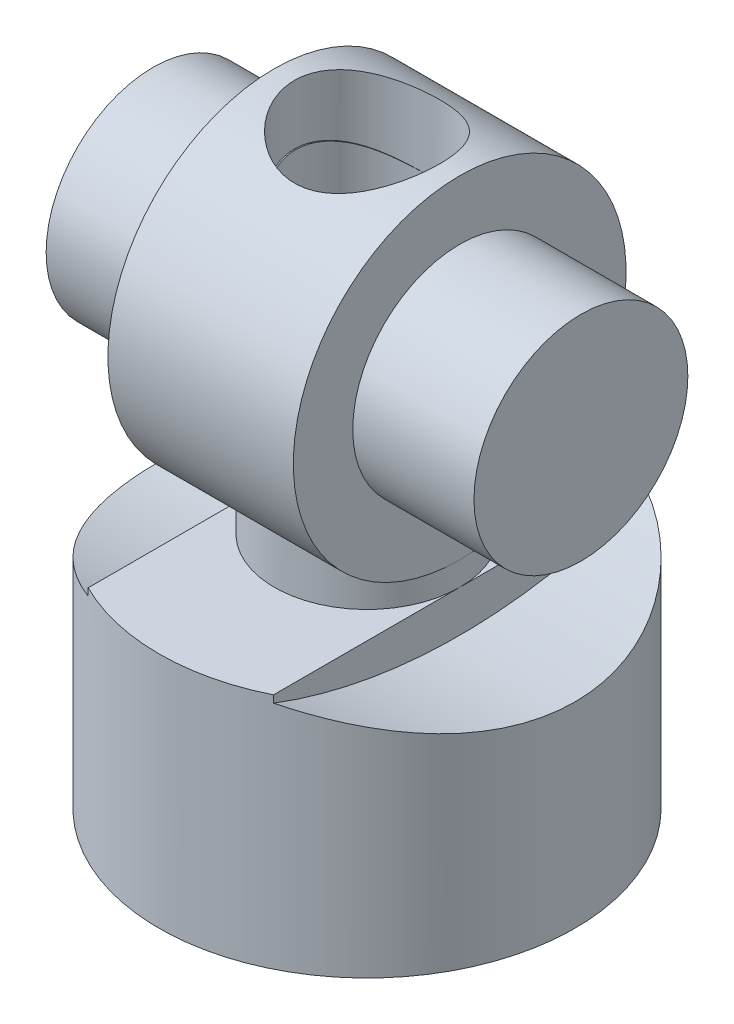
ISO-10303-21;
HEADER;
FILE_DESCRIPTION(('STEP AP214'),'2;1');
FILE_NAME('part.step','',(''),(''),'','','');
FILE_SCHEMA(('AUTOMOTIVE_DESIGN { 1 0 10303 214 1 1 1 1 }'));
ENDSEC;
DATA;
#1=APPLICATION_CONTEXT('core data for automotive mechanical design processes');
#2=APPLICATION_PROTOCOL_DEFINITION('international standard','automotive_design',2000,#1);
#3=PRODUCT_CONTEXT('',#1,'mechanical');
#4=PRODUCT('Part','Part','',(#3));
#5=PRODUCT_RELATED_PRODUCT_CATEGORY('part','',(#4));
#6=PRODUCT_DEFINITION_FORMATION('','',#4);
#7=PRODUCT_DEFINITION_CONTEXT('part definition',#1,'design');
#8=PRODUCT_DEFINITION('design','',#6,#7);
#9=PRODUCT_DEFINITION_SHAPE('','',#8);
#10=(LENGTH_UNIT() NAMED_UNIT(*) SI_UNIT(.MILLI.,.METRE.));
#11=(NAMED_UNIT(*) PLANE_ANGLE_UNIT() SI_UNIT($,.RADIAN.));
#12=(NAMED_UNIT(*) SI_UNIT($,.STERADIAN.) SOLID_ANGLE_UNIT());
#13=UNCERTAINTY_MEASURE_WITH_UNIT(LENGTH_MEASURE(1.E-05),#10,'distance_accuracy_value','');
#14=(GEOMETRIC_REPRESENTATION_CONTEXT(3) GLOBAL_UNCERTAINTY_ASSIGNED_CONTEXT((#13)) GLOBAL_UNIT_ASSIGNED_CONTEXT((#10,
#11,#12)) REPRESENTATION_CONTEXT('',''));
#15=CARTESIAN_POINT('',(0.,0.,0.));
#16=DIRECTION('',(0.,0.,1.));
#17=DIRECTION('',(1.,0.,0.));
#18=AXIS2_PLACEMENT_3D('',#15,#16,#17);
#19=CARTESIAN_POINT('',(0.,-18.,0.));
#20=DIRECTION('',(0.,-1.,0.));
#21=DIRECTION('',(0.,0.,-1.));
#22=AXIS2_PLACEMENT_3D('',#19,#20,#21);
#23=CYLINDRICAL_SURFACE('',#22,3.05);
#24=CARTESIAN_POINT('',(-3.05,7.,0.));
#25=CARTESIAN_POINT('',(-3.04999184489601,6.99999348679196,-0.162704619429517));
#26=CARTESIAN_POINT('',(-3.03690325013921,6.99426313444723,-0.325677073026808));
#27=CARTESIAN_POINT('',(-2.9850564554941,6.97191024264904,-0.646949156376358));
#28=CARTESIAN_POINT('',(-2.9462348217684,6.95526078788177,-0.805236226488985));
#29=CARTESIAN_POINT('',(-2.84464299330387,6.91284166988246,-1.11198429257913));
#30=CARTESIAN_POINT('',(-2.78195691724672,6.88710406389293,-1.26047767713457));
#31=CARTESIAN_POINT('',(-2.63478306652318,6.82898400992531,-1.54468326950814));
#32=CARTESIAN_POINT('',(-2.5503007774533,6.79660323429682,-1.68039868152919));
#33=CARTESIAN_POINT('',(-2.35713926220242,6.72644929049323,-1.94273441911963));
#34=CARTESIAN_POINT('',(-2.24747328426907,6.68848909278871,-2.0685776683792));
#35=CARTESIAN_POINT('',(-2.00914953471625,6.61221907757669,-2.3007657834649));
#36=CARTESIAN_POINT('',(-1.88048095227,6.57390907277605,-2.40709947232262));
#37=CARTESIAN_POINT('',(-1.59925069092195,6.49890558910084,-2.60304524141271));
#38=CARTESIAN_POINT('',(-1.44576451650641,6.46241666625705,-2.69141714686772));
#39=CARTESIAN_POINT('',(-1.12429520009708,6.39819011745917,-2.84074274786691));
#40=CARTESIAN_POINT('',(-0.956320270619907,6.37044757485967,-2.90171185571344));
#41=CARTESIAN_POINT('',(-0.619583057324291,6.32889846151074,-2.99121728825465));
#42=CARTESIAN_POINT('',(-0.451302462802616,6.31445045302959,-3.02125585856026));
#43=CARTESIAN_POINT('',(-0.11151746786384,6.29930260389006,-3.05272420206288));
#44=CARTESIAN_POINT('',(0.059984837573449,6.29859411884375,-3.0541719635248));
#45=CARTESIAN_POINT('',(0.385701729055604,6.31046776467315,-3.02954141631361));
#46=CARTESIAN_POINT('',(0.540142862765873,6.32192110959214,-3.0058010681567));
#47=CARTESIAN_POINT('',(0.84257968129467,6.35490505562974,-2.93541752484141));
#48=CARTESIAN_POINT('',(0.990573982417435,6.37643780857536,-2.88876943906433));
#49=CARTESIAN_POINT('',(1.27982174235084,6.4276508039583,-2.77297194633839));
#50=CARTESIAN_POINT('',(1.42085364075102,6.4575007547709,-2.70334757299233));
#51=CARTESIAN_POINT('',(1.6898138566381,6.52195425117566,-2.54391340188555));
#52=CARTESIAN_POINT('',(1.81773672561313,6.55655975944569,-2.45409526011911));
#53=CARTESIAN_POINT('',(2.06940274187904,6.63054514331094,-2.2470063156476));
#54=CARTESIAN_POINT('',(2.19164412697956,6.67006933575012,-2.12795670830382));
#55=CARTESIAN_POINT('',(2.4149580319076,6.74674039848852,-1.87069513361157));
#56=CARTESIAN_POINT('',(2.51602463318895,6.78388660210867,-1.7324778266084));
#57=CARTESIAN_POINT('',(2.69660971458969,6.8528854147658,-1.43587567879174));
#58=CARTESIAN_POINT('',(2.77546244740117,6.88456523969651,-1.27704227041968));
#59=CARTESIAN_POINT('',(2.9047911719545,6.93770958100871,-0.946630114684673));
#60=CARTESIAN_POINT('',(2.9552843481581,6.9591802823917,-0.775059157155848));
#61=CARTESIAN_POINT('',(3.02319063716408,6.98829825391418,-0.436544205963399));
#62=CARTESIAN_POINT('',(3.04261573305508,6.99678458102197,-0.27007608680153));
#63=CARTESIAN_POINT('',(3.05390053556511,7.00169785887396,0.0639465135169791));
#64=CARTESIAN_POINT('',(3.0457691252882,6.99812869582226,0.231500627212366));
#65=CARTESIAN_POINT('',(3.00356158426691,6.97986824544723,0.553152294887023));
#66=CARTESIAN_POINT('',(2.97094639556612,6.96580349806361,0.707481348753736));
#67=CARTESIAN_POINT('',(2.88278479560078,6.92866190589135,1.00827829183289));
#68=CARTESIAN_POINT('',(2.82723555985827,6.90558395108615,1.15474521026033));
#69=CARTESIAN_POINT('',(2.6929926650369,6.85170199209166,1.44084808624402));
#70=CARTESIAN_POINT('',(2.61362998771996,6.82067908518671,1.58012754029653));
#71=CARTESIAN_POINT('',(2.43474310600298,6.75415317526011,1.84389482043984));
#72=CARTESIAN_POINT('',(2.33521020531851,6.71864824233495,1.96837622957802));
#73=CARTESIAN_POINT('',(2.10978279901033,6.64353349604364,2.2092054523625));
#74=CARTESIAN_POINT('',(1.98244058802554,6.60381912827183,2.32416895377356));
#75=CARTESIAN_POINT('',(1.70973248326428,6.52714207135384,2.53153470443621));
#76=CARTESIAN_POINT('',(1.56436100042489,6.49018024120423,2.6239299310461));
#77=CARTESIAN_POINT('',(1.25564984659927,6.42269914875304,2.7850949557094));
#78=CARTESIAN_POINT('',(1.09200468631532,6.39232632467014,2.85334562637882));
#79=CARTESIAN_POINT('',(0.75379241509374,6.34333096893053,2.96069197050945));
#80=CARTESIAN_POINT('',(0.579235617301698,6.32469752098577,2.9998147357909));
#81=CARTESIAN_POINT('',(0.239649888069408,6.30306413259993,3.04498807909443));
#82=CARTESIAN_POINT('',(0.0750213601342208,6.29890231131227,3.05349858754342));
#83=CARTESIAN_POINT('',(-0.253252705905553,6.30354849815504,3.04389705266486));
#84=CARTESIAN_POINT('',(-0.416898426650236,6.31235401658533,3.02579011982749));
#85=CARTESIAN_POINT('',(-0.729129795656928,6.34083967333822,2.96559521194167));
#86=CARTESIAN_POINT('',(-0.878046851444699,6.35988779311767,2.92489692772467));
#87=CARTESIAN_POINT('',(-1.16693860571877,6.40615957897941,2.82210528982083));
#88=CARTESIAN_POINT('',(-1.30691072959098,6.43338558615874,2.76000580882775));
#89=CARTESIAN_POINT('',(-1.58358157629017,6.49506654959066,2.61169289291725));
#90=CARTESIAN_POINT('',(-1.71951916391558,6.52986875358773,2.5242072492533));
#91=CARTESIAN_POINT('',(-1.97555265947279,6.60190781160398,2.32929089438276));
#92=CARTESIAN_POINT('',(-2.09564225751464,6.63914562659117,2.22185227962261));
#93=CARTESIAN_POINT('',(-2.32680566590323,6.71555274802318,1.97959176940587));
#94=CARTESIAN_POINT('',(-2.43631261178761,6.75462711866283,1.84324010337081));
#95=CARTESIAN_POINT('',(-2.631061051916,6.82728275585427,1.55259912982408));
#96=CARTESIAN_POINT('',(-2.71629153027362,6.86086152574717,1.39830172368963));
#97=CARTESIAN_POINT('',(-2.82308954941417,6.90407953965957,1.15770046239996));
#98=CARTESIAN_POINT('',(-2.85504893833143,6.9172350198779,1.07649571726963));
#99=CARTESIAN_POINT('',(-2.91197877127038,6.94092534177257,0.911314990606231));
#100=CARTESIAN_POINT('',(-2.93695256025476,6.95146143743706,0.827340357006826));
#101=CARTESIAN_POINT('',(-2.97957896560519,6.96957822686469,0.657467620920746));
#102=CARTESIAN_POINT('',(-2.99724927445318,6.97716606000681,0.57157470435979));
#103=CARTESIAN_POINT('',(-3.02513606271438,6.98919084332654,0.398412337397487));
#104=CARTESIAN_POINT('',(-3.03535781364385,6.99363002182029,0.311143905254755));
#105=CARTESIAN_POINT('',(-3.04452810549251,6.99761719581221,0.186386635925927));
#106=CARTESIAN_POINT('',(-3.04657900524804,6.99850984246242,0.149145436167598));
#107=CARTESIAN_POINT('',(-3.04931589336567,6.9997019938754,0.0746075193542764));
#108=CARTESIAN_POINT('',(-3.0500018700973,7.00000149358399,0.0373108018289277));
#109=CARTESIAN_POINT('',(-3.05,7.,0.));
#110=B_SPLINE_CURVE_WITH_KNOTS('',3,(#24,#25,#26,#27,#28,#29,#30,#31,#32,#33,#34,#35,#36,#37,
#38,#39,#40,#41,#42,#43,#44,#45,#46,#47,#48,#49,#50,#51,#52,#53,#54,#55,#56,#57,#58,#59,#60,#61,
#62,#63,#64,#65,#66,#67,#68,#69,#70,#71,#72,#73,#74,#75,#76,#77,#78,#79,#80,#81,#82,#83,#84,#85,
#86,#87,#88,#89,#90,#91,#92,#93,#94,#95,#96,#97,#98,#99,#100,#101,#102,#103,#104,#105,#106,#107,
#108,#109),.UNSPECIFIED.,.T.,.F.,(4,2,2,2,2,2,2,2,2,2,2,2,2,2,2,2,2,2,2,2,2,2,2,2,2,2,2,2,2,2,2,
2,2,2,2,2,2,2,2,2,2,2,4),(0.,0.487968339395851,0.97714405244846,1.46461122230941,
1.95195582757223,2.46330122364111,2.97493865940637,3.51469503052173,4.05414744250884,
4.56594870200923,5.07742794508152,5.54526824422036,6.01320846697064,6.49150094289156,
6.96999141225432,7.49309500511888,8.0163446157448,8.55392067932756,9.09117064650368,
9.59196918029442,10.0926062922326,10.5655333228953,11.0385186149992,11.5262847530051,
12.0142616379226,12.5401685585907,13.0662389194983,13.6030164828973,14.1392941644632,
14.6313741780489,15.1233597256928,15.5879838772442,16.0527411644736,16.5467639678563,
17.0409828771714,17.576072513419,18.1114045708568,18.375869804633,18.6402081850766,
18.9039024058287,19.1674098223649,19.2793079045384,19.3912069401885),.UNSPECIFIED.);
#111=CARTESIAN_POINT('',(-3.05,7.,0.));
#112=VERTEX_POINT('',#111);
#113=EDGE_CURVE('E84',#112,#112,#110,.T.);
#114=ORIENTED_EDGE('',*,*,#113,.F.);
#115=EDGE_LOOP('',(#114));
#116=FACE_BOUND('',#115,.T.);
#117=CARTESIAN_POINT('',(0.,3.30870065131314,-3.05));
#118=CARTESIAN_POINT('',(-0.0740543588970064,3.30870135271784,-3.04999955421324));
#119=CARTESIAN_POINT('',(-0.148113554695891,3.31120079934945,-3.04729547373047));
#120=CARTESIAN_POINT('',(-0.295501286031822,3.32105327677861,-3.03655247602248));
#121=CARTESIAN_POINT('',(-0.368829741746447,3.32840683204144,-3.02851298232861));
#122=CARTESIAN_POINT('',(-0.58695059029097,3.35728100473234,-2.99658701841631));
#123=CARTESIAN_POINT('',(-0.729787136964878,3.385614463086,-2.96489335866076));
#124=CARTESIAN_POINT('',(-1.00481607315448,3.45535402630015,-2.88328172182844));
#125=CARTESIAN_POINT('',(-1.13710040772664,3.49662694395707,-2.83354864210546));
#126=CARTESIAN_POINT('',(-1.39123632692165,3.58733287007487,-2.71780374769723));
#127=CARTESIAN_POINT('',(-1.51308617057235,3.63676723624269,-2.65178922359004));
#128=CARTESIAN_POINT('',(-1.76446479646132,3.74781440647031,-2.49293203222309));
#129=CARTESIAN_POINT('',(-1.8920441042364,3.81010328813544,-2.39747643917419));
#130=CARTESIAN_POINT('',(-2.13108358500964,3.93428541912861,-2.18776550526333));
#131=CARTESIAN_POINT('',(-2.2425254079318,3.99617814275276,-2.0734890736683));
#132=CARTESIAN_POINT('',(-2.46301512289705,4.1236708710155,-1.80832137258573));
#133=CARTESIAN_POINT('',(-2.56913328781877,4.1884081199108,-1.65450535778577));
#134=CARTESIAN_POINT('',(-2.70696690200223,4.2748001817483,-1.40843177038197));
#135=CARTESIAN_POINT('',(-2.74934801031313,4.30180769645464,-1.32386688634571));
#136=CARTESIAN_POINT('',(-2.82644155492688,4.35148238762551,-1.15011183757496));
#137=CARTESIAN_POINT('',(-2.86115705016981,4.37415129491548,-1.06092353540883));
#138=CARTESIAN_POINT('',(-2.93723315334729,4.42421178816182,-0.834029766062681));
#139=CARTESIAN_POINT('',(-2.97356864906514,4.44850916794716,-0.693888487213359));
#140=CARTESIAN_POINT('',(-3.02602447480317,4.48374237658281,-0.40832853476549));
#141=CARTESIAN_POINT('',(-3.04216027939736,4.49468843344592,-0.262913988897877));
#142=CARTESIAN_POINT('',(-3.0533671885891,4.5022807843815,0.0293654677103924));
#143=CARTESIAN_POINT('',(-3.04840293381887,4.49890307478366,0.176232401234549));
#144=CARTESIAN_POINT('',(-3.01761506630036,4.47809945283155,0.466749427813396));
#145=CARTESIAN_POINT('',(-2.99178532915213,4.46066941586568,0.610398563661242));
#146=CARTESIAN_POINT('',(-2.92131598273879,4.41371882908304,0.888013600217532));
#147=CARTESIAN_POINT('',(-2.87702540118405,4.384422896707,1.02210773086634));
#148=CARTESIAN_POINT('',(-2.77159197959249,4.31597239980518,1.28074304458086));
#149=CARTESIAN_POINT('',(-2.71044594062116,4.27681596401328,1.40528240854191));
#150=CARTESIAN_POINT('',(-2.56551457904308,4.18638203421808,1.65649516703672));
#151=CARTESIAN_POINT('',(-2.47995424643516,4.13423576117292,1.78182668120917));
#152=CARTESIAN_POINT('',(-2.29260341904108,4.02464324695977,2.01721180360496));
#153=CARTESIAN_POINT('',(-2.19079412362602,3.96719089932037,2.12724743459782));
#154=CARTESIAN_POINT('',(-1.95420691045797,3.84118755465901,2.34819750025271));
#155=CARTESIAN_POINT('',(-1.81676442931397,3.7723979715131,2.45613438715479));
#156=CARTESIAN_POINT('',(-1.52359640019,3.64029455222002,2.64798057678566));
#157=CARTESIAN_POINT('',(-1.36788117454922,3.57697765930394,2.7319033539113));
#158=CARTESIAN_POINT('',(-1.07873972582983,3.47813281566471,2.85610629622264));
#159=CARTESIAN_POINT('',(-0.94878391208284,3.43957561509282,2.90201639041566));
#160=CARTESIAN_POINT('',(-0.680934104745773,3.37555318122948,2.97625031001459));
#161=CARTESIAN_POINT('',(-0.543055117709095,3.35006405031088,3.00460625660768));
#162=CARTESIAN_POINT('',(-0.261369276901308,3.31605166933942,3.04212029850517));
#163=CARTESIAN_POINT('',(-0.117523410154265,3.30766771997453,3.05112079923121));
#164=CARTESIAN_POINT('',(0.169846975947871,3.30994043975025,3.04865479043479));
#165=CARTESIAN_POINT('',(0.313371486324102,3.32059763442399,3.03718771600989));
#166=CARTESIAN_POINT('',(0.579273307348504,3.35672225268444,2.99716587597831));
#167=CARTESIAN_POINT('',(0.702224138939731,3.3804057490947,2.97065905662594));
#168=CARTESIAN_POINT('',(0.94170771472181,3.43813602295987,2.9036484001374));
#169=CARTESIAN_POINT('',(1.05823445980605,3.47219229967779,2.86313172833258));
#170=CARTESIAN_POINT('',(1.33453129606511,3.56435394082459,2.74826045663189));
#171=CARTESIAN_POINT('',(1.49008084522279,3.62637602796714,2.6668870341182));
#172=CARTESIAN_POINT('',(1.78349065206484,3.75646016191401,2.48031899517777));
#173=CARTESIAN_POINT('',(1.92131746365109,3.82453323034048,2.37508034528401));
#174=CARTESIAN_POINT('',(2.17938375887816,3.9604362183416,2.14091948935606));
#175=CARTESIAN_POINT('',(2.2993553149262,4.02824992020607,2.01169148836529));
#176=CARTESIAN_POINT('',(2.51660188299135,4.15609145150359,1.73217770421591));
#177=CARTESIAN_POINT('',(2.61391283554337,4.21613154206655,1.58192588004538));
#178=CARTESIAN_POINT('',(2.76724452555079,4.31303677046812,1.29108040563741));
#179=CARTESIAN_POINT('',(2.82752395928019,4.35212259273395,1.15347804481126));
#180=CARTESIAN_POINT('',(2.927713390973,4.41786925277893,0.868215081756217));
#181=CARTESIAN_POINT('',(2.96763645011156,4.44453805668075,0.720560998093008));
#182=CARTESIAN_POINT('',(3.02511265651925,4.48311795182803,0.41827986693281));
#183=CARTESIAN_POINT('',(3.04255880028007,4.49495844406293,0.263623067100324));
#184=CARTESIAN_POINT('',(3.05359112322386,4.50243250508,-0.0469294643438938));
#185=CARTESIAN_POINT('',(3.04718207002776,4.49806931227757,-0.202824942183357));
#186=CARTESIAN_POINT('',(3.01241336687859,4.47459437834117,-0.498210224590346));
#187=CARTESIAN_POINT('',(2.98584821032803,4.45668871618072,-0.638015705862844));
#188=CARTESIAN_POINT('',(2.91428327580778,4.40906289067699,-0.910676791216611));
#189=CARTESIAN_POINT('',(2.86928056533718,4.37934084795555,-1.04353128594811));
#190=CARTESIAN_POINT('',(2.75996758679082,4.30849145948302,-1.30628099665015));
#191=CARTESIAN_POINT('',(2.69478198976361,4.26685537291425,-1.43567105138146));
#192=CARTESIAN_POINT('',(2.54831500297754,4.17589690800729,-1.68200981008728));
#193=CARTESIAN_POINT('',(2.46702497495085,4.12657040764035,-1.79895178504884));
#194=CARTESIAN_POINT('',(2.27621742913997,4.01518689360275,-2.03669083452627));
#195=CARTESIAN_POINT('',(2.16426874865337,3.95235046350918,-2.15517053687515));
#196=CARTESIAN_POINT('',(1.92324507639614,3.82568072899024,-2.37276837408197));
#197=CARTESIAN_POINT('',(1.79415533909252,3.76184660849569,-2.47186965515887));
#198=CARTESIAN_POINT('',(1.52700320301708,3.6422101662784,-2.64476720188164));
#199=CARTESIAN_POINT('',(1.38971103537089,3.58616592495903,-2.71958017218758));
#200=CARTESIAN_POINT('',(1.10202420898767,3.48481309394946,-2.84829695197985));
#201=CARTESIAN_POINT('',(0.951651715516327,3.43948680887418,-2.90223532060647));
#202=CARTESIAN_POINT('',(0.668272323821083,3.37324804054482,-2.97881254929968));
#203=CARTESIAN_POINT('',(0.537042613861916,3.34940288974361,-3.00534763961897));
#204=CARTESIAN_POINT('',(0.337187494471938,3.32517436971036,-3.03205239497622));
#205=CARTESIAN_POINT('',(0.270072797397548,3.3190214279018,-3.03877098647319));
#206=CARTESIAN_POINT('',(0.135306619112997,3.31078493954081,-3.04774423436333));
#207=CARTESIAN_POINT('',(0.0676553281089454,3.30870001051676,-3.05000040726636));
#208=CARTESIAN_POINT('',(0.,3.30870065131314,-3.05));
#209=B_SPLINE_CURVE_WITH_KNOTS('',3,(#117,#118,#119,#120,#121,#122,#123,#124,#125,#126,#127,
#128,#129,#130,#131,#132,#133,#134,#135,#136,#137,#138,#139,#140,#141,#142,#143,#144,#145,#146,
#147,#148,#149,#150,#151,#152,#153,#154,#155,#156,#157,#158,#159,#160,#161,#162,#163,#164,#165,
#166,#167,#168,#169,#170,#171,#172,#173,#174,#175,#176,#177,#178,#179,#180,#181,#182,#183,#184,
#185,#186,#187,#188,#189,#190,#191,#192,#193,#194,#195,#196,#197,#198,#199,#200,#201,#202,#203,
#204,#205,#206,#207,#208),.UNSPECIFIED.,.T.,.F.,(4,2,2,2,2,2,2,2,2,2,2,2,2,2,2,2,2,2,2,2,2,2,2,
2,2,2,2,2,2,2,2,2,2,2,2,2,2,2,2,2,2,2,2,2,2,4),(0.,0.22207460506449,0.444173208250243,
0.888639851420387,1.32867397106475,1.76878136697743,2.28012572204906,2.79204704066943,
3.3816546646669,3.67634407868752,3.97091568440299,4.40924515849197,4.84723863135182,
5.28596638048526,5.72482295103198,6.1557338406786,6.58672656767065,7.06630172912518,
7.54643585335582,8.10749203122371,8.66823277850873,9.09600687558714,9.52299588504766,
9.95344853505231,10.3839130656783,10.7663784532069,11.1491951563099,11.7047959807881,
12.2614304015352,12.8257196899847,13.3891078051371,13.8528597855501,14.3163138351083,
14.7819661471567,15.247525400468,15.6758920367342,16.104326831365,16.5548361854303,
17.0055878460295,17.527655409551,18.0501750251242,18.5465955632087,19.0421906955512,
19.4481632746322,19.6511174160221,19.854002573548),.UNSPECIFIED.);
#210=CARTESIAN_POINT('',(0.,3.30870065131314,-3.05));
#211=VERTEX_POINT('',#210);
#212=EDGE_CURVE('E376',#211,#211,#209,.T.);
#213=ORIENTED_EDGE('',*,*,#212,.F.);
#214=EDGE_LOOP('',(#213));
#215=FACE_BOUND('',#214,.T.);
#216=ADVANCED_FACE('F14',(#116,#215),#23,.F.);
#217=CARTESIAN_POINT('',(9.,0.,0.));
#218=DIRECTION('',(-1.,0.,0.));
#219=DIRECTION('',(0.,0.,1.));
#220=AXIS2_PLACEMENT_3D('',#217,#218,#219);
#221=CYLINDRICAL_SURFACE('',#220,4.5);
#222=CARTESIAN_POINT('',(2.17944947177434,4.00000000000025,-2.06155281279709));
#223=CARTESIAN_POINT('',(2.28837122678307,4.05934481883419,-1.94640452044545));
#224=CARTESIAN_POINT('',(2.38866067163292,4.11708651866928,-1.82213099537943));
#225=CARTESIAN_POINT('',(2.56961094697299,4.22464336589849,-1.55655846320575));
#226=CARTESIAN_POINT('',(2.65025394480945,4.27445129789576,-1.41524416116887));
#227=CARTESIAN_POINT('',(2.75423796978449,4.33994336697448,-1.19205745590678));
#228=CARTESIAN_POINT('',(2.7861647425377,4.36030167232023,-1.11545522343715));
#229=CARTESIAN_POINT('',(2.84377728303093,4.39733769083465,-0.959093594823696));
#230=CARTESIAN_POINT('',(2.86946615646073,4.41401723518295,-0.87933579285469));
#231=CARTESIAN_POINT('',(2.91419299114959,4.44322348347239,-0.717312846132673));
#232=CARTESIAN_POINT('',(2.93323695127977,4.45575393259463,-0.635050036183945));
#233=CARTESIAN_POINT('',(2.96437345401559,4.47631237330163,-0.468667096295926));
#234=CARTESIAN_POINT('',(2.9764670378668,4.4843410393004,-0.384547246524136));
#235=CARTESIAN_POINT('',(2.99248782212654,4.49499197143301,-0.225104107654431));
#236=CARTESIAN_POINT('',(2.99720004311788,4.49813364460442,-0.149893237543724));
#237=CARTESIAN_POINT('',(3.00094629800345,4.50063068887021,0.000760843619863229));
#238=CARTESIAN_POINT('',(2.99997839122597,4.49998476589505,0.0762041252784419));
#239=CARTESIAN_POINT('',(2.99237371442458,4.49491844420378,0.226642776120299));
#240=CARTESIAN_POINT('',(2.98573966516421,4.49049985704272,0.301638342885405));
#241=CARTESIAN_POINT('',(2.96691459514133,4.47800574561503,0.450629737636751));
#242=CARTESIAN_POINT('',(2.95472145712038,4.4699288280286,0.524625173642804));
#243=CARTESIAN_POINT('',(2.91192109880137,4.44171418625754,0.735024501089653));
#244=CARTESIAN_POINT('',(2.87453024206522,4.41720240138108,0.869537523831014));
#245=CARTESIAN_POINT('',(2.78250021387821,4.35787558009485,1.12996402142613));
#246=CARTESIAN_POINT('',(2.72785968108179,4.32305973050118,1.25587681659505));
#247=CARTESIAN_POINT('',(2.60015120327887,4.24360201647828,1.50317100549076));
#248=CARTESIAN_POINT('',(2.52630462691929,4.1985588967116,1.6240191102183));
#249=CARTESIAN_POINT('',(2.36369130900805,4.10276992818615,1.85275235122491));
#250=CARTESIAN_POINT('',(2.27491222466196,4.05201937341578,1.96062663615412));
#251=CARTESIAN_POINT('',(2.06202888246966,3.93601540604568,2.18569349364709));
#252=CARTESIAN_POINT('',(1.93449632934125,3.87011117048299,2.29932213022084));
#253=CARTESIAN_POINT('',(1.66109626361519,3.7409522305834,2.50398026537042));
#254=CARTESIAN_POINT('',(1.51522408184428,3.67769820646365,2.59500399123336));
#255=CARTESIAN_POINT('',(1.23451031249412,3.57215507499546,2.73790605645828));
#256=CARTESIAN_POINT('',(1.1024088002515,3.52814168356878,2.79388129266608));
#257=CARTESIAN_POINT('',(0.82834135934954,3.45238806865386,2.88698168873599));
#258=CARTESIAN_POINT('',(0.686392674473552,3.42062699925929,2.92413889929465));
#259=CARTESIAN_POINT('',(0.467825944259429,3.38578850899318,2.96424324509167));
#260=CARTESIAN_POINT('',(0.393585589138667,3.37629258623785,2.97502211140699));
#261=CARTESIAN_POINT('',(0.244064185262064,3.36214916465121,2.99099857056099));
#262=CARTESIAN_POINT('',(0.168783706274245,3.35749911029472,2.99619910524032));
#263=CARTESIAN_POINT('',(0.0179222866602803,3.353302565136,3.00089526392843));
#264=CARTESIAN_POINT('',(-0.0576585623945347,3.35375462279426,3.00039251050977));
#265=CARTESIAN_POINT('',(-0.208343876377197,3.35972117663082,2.99370814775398));
#266=CARTESIAN_POINT('',(-0.283448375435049,3.36523530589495,2.98752695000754));
#267=CARTESIAN_POINT('',(-0.484126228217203,3.38654926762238,2.96339711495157));
#268=CARTESIAN_POINT('',(-0.60864784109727,3.40682685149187,2.94026468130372));
#269=CARTESIAN_POINT('',(-0.85158741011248,3.45846897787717,2.87933265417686));
#270=CARTESIAN_POINT('',(-0.969999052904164,3.489844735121,2.84151822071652));
#271=CARTESIAN_POINT('',(-1.2446692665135,3.57435214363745,2.73500490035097));
#272=CARTESIAN_POINT('',(-1.3973523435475,3.63117923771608,2.66000577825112));
#273=CARTESIAN_POINT('',(-1.68613864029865,3.75176844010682,2.48704032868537));
#274=CARTESIAN_POINT('',(-1.8222130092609,3.81554226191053,2.38903487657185));
#275=CARTESIAN_POINT('',(-2.07815007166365,3.9441504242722,2.17026038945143));
#276=CARTESIAN_POINT('',(-2.197741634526,4.00898643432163,2.04917455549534));
#277=CARTESIAN_POINT('',(-2.41587710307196,4.13260295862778,1.78677673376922));
#278=CARTESIAN_POINT('',(-2.51444778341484,4.19139112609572,1.64549086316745));
#279=CARTESIAN_POINT('',(-2.67486353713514,4.28969657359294,1.36643124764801));
#280=CARTESIAN_POINT('',(-2.73995243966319,4.33076963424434,1.23107835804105));
#281=CARTESIAN_POINT('',(-2.8498002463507,4.40108784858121,0.949441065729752));
#282=CARTESIAN_POINT('',(-2.89457128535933,4.43034006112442,0.803163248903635));
#283=CARTESIAN_POINT('',(-2.96163502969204,4.47444249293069,0.502535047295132));
#284=CARTESIAN_POINT('',(-2.98380793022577,4.4892159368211,0.348146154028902));
#285=CARTESIAN_POINT('',(-3.00381078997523,4.50253461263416,0.0371097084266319));
#286=CARTESIAN_POINT('',(-3.00164892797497,4.50108529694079,-0.119537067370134));
#287=CARTESIAN_POINT('',(-2.97446734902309,4.48300966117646,-0.415464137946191));
#288=CARTESIAN_POINT('',(-2.95153841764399,4.46777168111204,-0.555031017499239));
#289=CARTESIAN_POINT('',(-2.88692828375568,4.42535450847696,-0.827830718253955));
#290=CARTESIAN_POINT('',(-2.84524373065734,4.39817318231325,-0.961062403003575));
#291=CARTESIAN_POINT('',(-2.74305092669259,4.33275088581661,-1.22319736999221));
#292=CARTESIAN_POINT('',(-2.68189653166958,4.29413404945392,-1.35175200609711));
#293=CARTESIAN_POINT('',(-2.54350670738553,4.20909116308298,-1.59700383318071));
#294=CARTESIAN_POINT('',(-2.46626729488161,4.162663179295,-1.71369807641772));
#295=CARTESIAN_POINT('',(-2.28496875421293,4.05768550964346,-1.95047851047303));
#296=CARTESIAN_POINT('',(-2.17862698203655,3.99836103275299,-2.06846856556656));
#297=CARTESIAN_POINT('',(-1.94898374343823,3.87800679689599,-2.2861645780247));
#298=CARTESIAN_POINT('',(-1.82564930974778,3.81697391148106,-2.38583409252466));
#299=CARTESIAN_POINT('',(-1.62040499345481,3.72442480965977,-2.52633828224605));
#300=CARTESIAN_POINT('',(-1.54366867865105,3.69156606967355,-2.57396715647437));
#301=CARTESIAN_POINT('',(-1.38540798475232,3.62823516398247,-2.66249251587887));
#302=CARTESIAN_POINT('',(-1.30388248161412,3.59776356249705,-2.7033874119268));
#303=CARTESIAN_POINT('',(-1.13655998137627,3.54056672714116,-2.77787527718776));
#304=CARTESIAN_POINT('',(-1.05077470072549,3.51383191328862,-2.81148704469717));
#305=CARTESIAN_POINT('',(-0.875250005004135,3.46539233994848,-2.87097974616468));
#306=CARTESIAN_POINT('',(-0.785513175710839,3.44368434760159,-2.8968656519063));
#307=CARTESIAN_POINT('',(-0.570316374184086,3.40009444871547,-2.94803042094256));
#308=CARTESIAN_POINT('',(-0.443446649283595,3.38086629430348,-2.96985675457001));
#309=CARTESIAN_POINT('',(-0.186731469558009,3.35687252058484,-2.99695777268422));
#310=CARTESIAN_POINT('',(-0.0568903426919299,3.35208706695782,-3.00225515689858));
#311=CARTESIAN_POINT('',(0.20208432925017,3.35768798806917,-2.99598781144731));
#312=CARTESIAN_POINT('',(0.331217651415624,3.36807889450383,-2.98441804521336));
#313=CARTESIAN_POINT('',(0.585248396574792,3.40243879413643,-2.94517638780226));
#314=CARTESIAN_POINT('',(0.710138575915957,3.42642988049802,-2.91747829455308));
#315=CARTESIAN_POINT('',(0.986916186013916,3.49302832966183,-2.83762805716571));
#316=CARTESIAN_POINT('',(1.1366421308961,3.53895871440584,-2.78081517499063));
#317=CARTESIAN_POINT('',(1.42242651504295,3.64079282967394,-2.64607783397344));
#318=CARTESIAN_POINT('',(1.55847767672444,3.69670182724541,-2.56814221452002));
#319=CARTESIAN_POINT('',(1.77661818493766,3.79473437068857,-2.41978107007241));
#320=CARTESIAN_POINT('',(1.8625466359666,3.83588744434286,-2.35426384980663));
#321=CARTESIAN_POINT('',(2.02680386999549,3.91827578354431,-2.21442881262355));
#322=CARTESIAN_POINT('',(2.10513578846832,3.95951100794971,-2.1401146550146));
#323=CARTESIAN_POINT('',(2.17944947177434,4.00000000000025,-2.06155281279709));
#324=B_SPLINE_CURVE_WITH_KNOTS('',3,(#222,#223,#224,#225,#226,#227,#228,#229,#230,#231,#232,
#233,#234,#235,#236,#237,#238,#239,#240,#241,#242,#243,#244,#245,#246,#247,#248,#249,#250,#251,
#252,#253,#254,#255,#256,#257,#258,#259,#260,#261,#262,#263,#264,#265,#266,#267,#268,#269,#270,
#271,#272,#273,#274,#275,#276,#277,#278,#279,#280,#281,#282,#283,#284,#285,#286,#287,#288,#289,
#290,#291,#292,#293,#294,#295,#296,#297,#298,#299,#300,#301,#302,#303,#304,#305,#306,#307,#308,
#309,#310,#311,#312,#313,#314,#315,#316,#317,#318,#319,#320,#321,#322,#323),.UNSPECIFIED.,.T.,
.F.,(4,2,2,2,2,2,2,2,2,2,2,2,2,2,2,2,2,2,2,2,2,2,2,2,2,2,2,2,2,2,2,2,2,2,2,2,2,2,2,2,2,2,2,2,2,
2,2,2,2,2,4),(0.,0.507413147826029,1.01528516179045,1.27132958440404,1.52724626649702,
1.78293131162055,2.03857804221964,2.26454822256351,2.49059561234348,2.71653451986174,
2.94255955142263,3.36583463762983,3.7891431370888,4.23341703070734,4.67805996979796,
5.22497732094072,5.7720341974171,6.22062975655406,6.66845868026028,6.89499774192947,
7.12141727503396,7.34777239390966,7.57411110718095,7.95712422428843,8.34052548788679,
8.87571277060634,9.41181687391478,9.95589217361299,10.499270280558,10.9644472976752,
11.4293461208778,11.8966969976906,12.3638908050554,12.7887142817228,13.213613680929,
13.6544163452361,14.0953282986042,14.6020877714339,15.1098446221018,15.397847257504,
15.6859177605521,15.9732356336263,16.2603682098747,16.649050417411,17.0371985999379,
17.4254627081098,17.8143593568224,18.3115039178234,18.8089116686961,19.1552463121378,
19.5014373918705),.UNSPECIFIED.);
#325=CARTESIAN_POINT('',(2.17944947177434,4.00000000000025,-2.06155281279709));
#326=VERTEX_POINT('',#325);
#327=EDGE_CURVE('E378',#326,#326,#324,.T.);
#328=ORIENTED_EDGE('',*,*,#327,.T.);
#329=EDGE_LOOP('',(#328));
#330=FACE_BOUND('',#329,.T.);
#331=ORIENTED_EDGE('',*,*,#212,.T.);
#332=EDGE_LOOP('',(#331));
#333=FACE_BOUND('',#332,.T.);
#334=ADVANCED_FACE('F348',(#330,#333),#221,.T.);
#335=CARTESIAN_POINT('',(0.,-5.,0.));
#336=DIRECTION('',(0.,-1.,0.));
#337=DIRECTION('',(0.,0.,-1.));
#338=AXIS2_PLACEMENT_3D('',#335,#336,#337);
#339=CYLINDRICAL_SURFACE('',#338,3.);
#340=ORIENTED_EDGE('',*,*,#327,.F.);
#341=EDGE_LOOP('',(#340));
#342=FACE_BOUND('',#341,.T.);
#343=CARTESIAN_POINT('',(0.,-3.35410196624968,3.));
#344=CARTESIAN_POINT('',(-0.0732569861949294,-3.35409414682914,3.00000458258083));
#345=CARTESIAN_POINT('',(-0.146481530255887,-3.35651144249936,2.99731244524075));
#346=CARTESIAN_POINT('',(-0.292242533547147,-3.36602370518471,2.98662615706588));
#347=CARTESIAN_POINT('',(-0.36477888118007,-3.37311941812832,2.97863116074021));
#348=CARTESIAN_POINT('',(-0.580557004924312,-3.40099728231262,2.94687150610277));
#349=CARTESIAN_POINT('',(-0.721887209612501,-3.42836960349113,2.91533243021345));
#350=CARTESIAN_POINT('',(-0.994135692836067,-3.49584414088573,2.83403844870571));
#351=CARTESIAN_POINT('',(-1.12514051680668,-3.53582228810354,2.78446038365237));
#352=CARTESIAN_POINT('',(-1.37678977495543,-3.62376255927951,2.66901051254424));
#353=CARTESIAN_POINT('',(-1.49743205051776,-3.67172634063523,2.60313532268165));
#354=CARTESIAN_POINT('',(-1.7454742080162,-3.77919120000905,2.44503375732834));
#355=CARTESIAN_POINT('',(-1.87100290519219,-3.83932601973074,2.35030173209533));
#356=CARTESIAN_POINT('',(-2.10599933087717,-3.95917042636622,2.14229810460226));
#357=CARTESIAN_POINT('',(-2.21545122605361,-4.01887953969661,2.02900845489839));
#358=CARTESIAN_POINT('',(-2.43098271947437,-4.14134123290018,1.76719317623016));
#359=CARTESIAN_POINT('',(-2.53429147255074,-4.20328759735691,1.61594159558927));
#360=CARTESIAN_POINT('',(-2.6683430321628,-4.28588873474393,1.37421346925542));
#361=CARTESIAN_POINT('',(-2.70954965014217,-4.31170810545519,1.29113866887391));
#362=CARTESIAN_POINT('',(-2.78442936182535,-4.35915144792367,1.12054013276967));
#363=CARTESIAN_POINT('',(-2.81810806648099,-4.38077854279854,1.03301977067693));
#364=CARTESIAN_POINT('',(-2.87404180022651,-4.41698044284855,0.864225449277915));
#365=CARTESIAN_POINT('',(-2.89715242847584,-4.43207302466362,0.78334499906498));
#366=CARTESIAN_POINT('',(-2.93658943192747,-4.45795195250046,0.619315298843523));
#367=CARTESIAN_POINT('',(-2.95291997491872,-4.46874094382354,0.536167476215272));
#368=CARTESIAN_POINT('',(-2.97850414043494,-4.48568768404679,0.368381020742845));
#369=CARTESIAN_POINT('',(-2.98776324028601,-4.49184901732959,0.28374359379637));
#370=CARTESIAN_POINT('',(-2.99905173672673,-4.49936633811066,0.11380694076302));
#371=CARTESIAN_POINT('',(-3.00108215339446,-4.50072300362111,0.0285078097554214));
#372=CARTESIAN_POINT('',(-2.99672182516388,-4.49781194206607,-0.201115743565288));
#373=CARTESIAN_POINT('',(-2.98351119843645,-4.48898902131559,-0.345332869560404));
#374=CARTESIAN_POINT('',(-2.93686864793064,-4.45812769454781,-0.628886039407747));
#375=CARTESIAN_POINT('',(-2.90343524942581,-4.4360883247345,-0.768221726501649));
#376=CARTESIAN_POINT('',(-2.81820508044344,-4.38078005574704,-1.03810942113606));
#377=CARTESIAN_POINT('',(-2.76648129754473,-4.34755581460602,-1.16869392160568));
#378=CARTESIAN_POINT('',(-2.64666991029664,-4.27231692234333,-1.41931574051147));
#379=CARTESIAN_POINT('',(-2.57857931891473,-4.2303006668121,-1.53935112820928));
#380=CARTESIAN_POINT('',(-2.41803177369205,-4.13427076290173,-1.78242579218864));
#381=CARTESIAN_POINT('',(-2.32354868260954,-4.07940610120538,-1.90378704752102));
#382=CARTESIAN_POINT('',(-2.11815201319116,-3.9660090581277,-2.12998228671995));
#383=CARTESIAN_POINT('',(-2.00721309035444,-3.90747110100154,-2.23479025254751));
#384=CARTESIAN_POINT('',(-1.75205517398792,-3.78225066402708,-2.44158347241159));
#385=CARTESIAN_POINT('',(-1.60534337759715,-3.71571479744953,-2.54060388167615));
#386=CARTESIAN_POINT('',(-1.29373524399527,-3.59213416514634,-2.71252313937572));
#387=CARTESIAN_POINT('',(-1.12887000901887,-3.53507357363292,-2.78546578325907));
#388=CARTESIAN_POINT('',(-0.83292140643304,-3.45394305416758,-2.88499086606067));
#389=CARTESIAN_POINT('',(-0.70560994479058,-3.42510546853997,-2.91886187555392));
#390=CARTESIAN_POINT('',(-0.445440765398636,-3.381135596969,-2.96969333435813));
#391=CARTESIAN_POINT('',(-0.312593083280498,-3.36597955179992,-2.98668310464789));
#392=CARTESIAN_POINT('',(-0.0443355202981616,-3.35171335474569,-3.0026910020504));
#393=CARTESIAN_POINT('',(0.091082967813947,-3.35267300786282,-3.0016309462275));
#394=CARTESIAN_POINT('',(0.359525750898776,-3.37064820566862,-2.98142444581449));
#395=CARTESIAN_POINT('',(0.492548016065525,-3.38767676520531,-2.96226334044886));
#396=CARTESIAN_POINT('',(0.746084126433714,-3.43391966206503,-2.90849716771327));
#397=CARTESIAN_POINT('',(0.866891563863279,-3.4624978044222,-2.87469261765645));
#398=CARTESIAN_POINT('',(1.10118935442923,-3.52844937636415,-2.79334562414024));
#399=CARTESIAN_POINT('',(1.21467723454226,-3.56582575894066,-2.74579856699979));
#400=CARTESIAN_POINT('',(1.45530300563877,-3.65417225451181,-2.6274501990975));
#401=CARTESIAN_POINT('',(1.5806352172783,-3.70636622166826,-2.55390043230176));
#402=CARTESIAN_POINT('',(1.81862520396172,-3.8139377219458,-2.39029097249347));
#403=CARTESIAN_POINT('',(1.93126727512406,-3.86931907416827,-2.30021117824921));
#404=CARTESIAN_POINT('',(2.16594352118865,-3.99113517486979,-2.08314986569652));
#405=CARTESIAN_POINT('',(2.28465427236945,-4.05734178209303,-1.95240579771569));
#406=CARTESIAN_POINT('',(2.49872502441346,-4.18163372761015,-1.6696492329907));
#407=CARTESIAN_POINT('',(2.59410565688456,-4.23972622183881,-1.51765571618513));
#408=CARTESIAN_POINT('',(2.74183760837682,-4.33186231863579,-1.226231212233));
#409=CARTESIAN_POINT('',(2.79893475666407,-4.36838187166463,-1.08999354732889));
#410=CARTESIAN_POINT('',(2.89291079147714,-4.4291806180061,-0.808135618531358));
#411=CARTESIAN_POINT('',(2.929806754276,-4.45347014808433,-0.662523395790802));
#412=CARTESIAN_POINT('',(2.98154544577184,-4.48767546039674,-0.365054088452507));
#413=CARTESIAN_POINT('',(2.99629001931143,-4.49752726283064,-0.21317225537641));
#414=CARTESIAN_POINT('',(3.00247177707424,-4.50164731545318,0.0912833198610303));
#415=CARTESIAN_POINT('',(2.99391112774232,-4.49591701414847,0.243856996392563));
#416=CARTESIAN_POINT('',(2.95551076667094,-4.47044333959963,0.533636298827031));
#417=CARTESIAN_POINT('',(2.92726352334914,-4.45174915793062,0.67115271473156));
#418=CARTESIAN_POINT('',(2.8526429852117,-4.40304159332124,0.939027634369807));
#419=CARTESIAN_POINT('',(2.80626687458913,-4.37302645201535,1.06938502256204));
#420=CARTESIAN_POINT('',(2.69409194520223,-4.3018764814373,1.32772094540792));
#421=CARTESIAN_POINT('',(2.62732454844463,-4.26019873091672,1.45512538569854));
#422=CARTESIAN_POINT('',(2.47777402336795,-4.16963112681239,1.69732899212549));
#423=CARTESIAN_POINT('',(2.3949813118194,-4.1207369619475,1.81212055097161));
#424=CARTESIAN_POINT('',(2.20105668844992,-4.01089395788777,2.04494134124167));
#425=CARTESIAN_POINT('',(2.08751563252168,-3.94925865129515,2.16064022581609));
#426=CARTESIAN_POINT('',(1.84332951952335,-3.82580042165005,2.37240030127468));
#427=CARTESIAN_POINT('',(1.7126717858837,-3.76397739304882,2.46844680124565));
#428=CARTESIAN_POINT('',(1.44619919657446,-3.65076300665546,2.63269891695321));
#429=CARTESIAN_POINT('',(1.31153938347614,-3.59893559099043,2.70247011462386));
#430=CARTESIAN_POINT('',(1.0300712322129,-3.50621323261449,2.82173662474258));
#431=CARTESIAN_POINT('',(0.883287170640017,-3.46529710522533,2.87127132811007));
#432=CARTESIAN_POINT('',(0.613848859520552,-3.40786372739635,2.93904512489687));
#433=CARTESIAN_POINT('',(0.493057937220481,-3.38794856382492,2.96178740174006));
#434=CARTESIAN_POINT('',(0.24814512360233,-3.36107964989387,2.99225476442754));
#435=CARTESIAN_POINT('',(0.124026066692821,-3.35411520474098,2.99999224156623));
#436=CARTESIAN_POINT('',(0.,-3.35410196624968,3.));
#437=B_SPLINE_CURVE_WITH_KNOTS('',3,(#343,#344,#345,#346,#347,#348,#349,#350,#351,#352,#353,
#354,#355,#356,#357,#358,#359,#360,#361,#362,#363,#364,#365,#366,#367,#368,#369,#370,#371,#372,
#373,#374,#375,#376,#377,#378,#379,#380,#381,#382,#383,#384,#385,#386,#387,#388,#389,#390,#391,
#392,#393,#394,#395,#396,#397,#398,#399,#400,#401,#402,#403,#404,#405,#406,#407,#408,#409,#410,
#411,#412,#413,#414,#415,#416,#417,#418,#419,#420,#421,#422,#423,#424,#425,#426,#427,#428,#429,
#430,#431,#432,#433,#434,#435,#436),.UNSPECIFIED.,.T.,.F.,(4,2,2,2,2,2,2,2,2,2,2,2,2,2,2,2,2,2,
2,2,2,2,2,2,2,2,2,2,2,2,2,2,2,2,2,2,2,2,2,2,2,2,2,2,2,2,4),(0.,0.219620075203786,
0.439275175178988,0.878823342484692,1.31417375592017,1.74961463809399,2.2528349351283,
2.75654755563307,3.33302024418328,3.62140722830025,3.90957854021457,4.16557735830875,
4.42141857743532,4.67706142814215,4.93266820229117,5.36561317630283,5.79858972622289,
6.22985763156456,6.6612043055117,7.14923304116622,7.63802137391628,8.20270070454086,
8.76642719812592,9.16941150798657,9.571694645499,9.97572071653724,10.3800743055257,
10.764666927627,11.1493888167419,11.6110086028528,12.0731935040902,12.636340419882,
13.1989875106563,13.653578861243,14.1077853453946,14.56399859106,15.0201694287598,
15.4431718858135,15.8662400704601,16.3137880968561,16.7616045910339,17.2798532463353,
17.7984879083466,18.2775320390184,18.7556392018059,19.1277693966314,19.4995921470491),.UNSPECIFIED.);
#438=CARTESIAN_POINT('',(0.,-3.35410196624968,3.));
#439=VERTEX_POINT('',#438);
#440=EDGE_CURVE('E18',#439,#439,#437,.T.);
#441=ORIENTED_EDGE('',*,*,#440,.T.);
#442=EDGE_LOOP('',(#441));
#443=FACE_BOUND('',#442,.T.);
#444=ADVANCED_FACE('F338',(#342,#443),#339,.F.);
#445=CARTESIAN_POINT('',(-9.,0.,0.));
#446=DIRECTION('',(1.,0.,0.));
#447=DIRECTION('',(0.,0.,-1.));
#448=AXIS2_PLACEMENT_3D('',#445,#446,#447);
#449=PLANE('',#448);
#450=CARTESIAN_POINT('',(-9.,0.,0.));
#451=DIRECTION('',(-1.,0.,0.));
#452=DIRECTION('',(0.,0.,1.));
#453=AXIS2_PLACEMENT_3D('',#450,#451,#452);
#454=CIRCLE('',#453,4.5);
#455=CARTESIAN_POINT('',(-9.,0.,4.5));
#456=VERTEX_POINT('',#455);
#457=EDGE_CURVE('E380',#456,#456,#454,.F.);
#458=ORIENTED_EDGE('',*,*,#457,.F.);
#459=EDGE_LOOP('',(#458));
#460=FACE_BOUND('',#459,.T.);
#461=ADVANCED_FACE('F328',(#460),#449,.F.);
#462=CARTESIAN_POINT('',(9.,0.,0.));
#463=DIRECTION('',(1.,0.,0.));
#464=DIRECTION('',(0.,0.,-1.));
#465=AXIS2_PLACEMENT_3D('',#462,#463,#464);
#466=PLANE('',#465);
#467=CARTESIAN_POINT('',(9.,0.,0.));
#468=DIRECTION('',(-1.,0.,0.));
#469=DIRECTION('',(0.,0.,1.));
#470=AXIS2_PLACEMENT_3D('',#467,#468,#469);
#471=CIRCLE('',#470,4.5);
#472=CARTESIAN_POINT('',(9.,0.,4.5));
#473=VERTEX_POINT('',#472);
#474=EDGE_CURVE('E404',#473,#473,#471,.T.);
#475=ORIENTED_EDGE('',*,*,#474,.F.);
#476=EDGE_LOOP('',(#475));
#477=FACE_BOUND('',#476,.T.);
#478=ADVANCED_FACE('F319',(#477),#466,.T.);
#479=CARTESIAN_POINT('',(9.,0.,0.));
#480=DIRECTION('',(-1.,0.,0.));
#481=DIRECTION('',(0.,0.,1.));
#482=AXIS2_PLACEMENT_3D('',#479,#480,#481);
#483=CYLINDRICAL_SURFACE('',#482,4.5);
#484=ORIENTED_EDGE('',*,*,#440,.F.);
#485=EDGE_LOOP('',(#484));
#486=FACE_BOUND('',#485,.T.);
#487=CARTESIAN_POINT('',(0.,-3.30870065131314,-3.05));
#488=CARTESIAN_POINT('',(0.0740543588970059,-3.30870135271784,-3.04999955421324));
#489=CARTESIAN_POINT('',(0.14811355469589,-3.31120079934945,-3.04729547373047));
#490=CARTESIAN_POINT('',(0.295501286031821,-3.32105327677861,-3.03655247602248));
#491=CARTESIAN_POINT('',(0.368829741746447,-3.32840683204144,-3.02851298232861));
#492=CARTESIAN_POINT('',(0.586950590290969,-3.35728100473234,-2.99658701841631));
#493=CARTESIAN_POINT('',(0.729787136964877,-3.385614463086,-2.96489335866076));
#494=CARTESIAN_POINT('',(1.00481607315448,-3.45535402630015,-2.88328172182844));
#495=CARTESIAN_POINT('',(1.13710040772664,-3.49662694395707,-2.83354864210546));
#496=CARTESIAN_POINT('',(1.39123632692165,-3.58733287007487,-2.71780374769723));
#497=CARTESIAN_POINT('',(1.51308617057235,-3.63676723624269,-2.65178922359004));
#498=CARTESIAN_POINT('',(1.76446479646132,-3.74781440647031,-2.49293203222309));
#499=CARTESIAN_POINT('',(1.8920441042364,-3.81010328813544,-2.39747643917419));
#500=CARTESIAN_POINT('',(2.13108358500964,-3.93428541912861,-2.18776550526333));
#501=CARTESIAN_POINT('',(2.2425254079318,-3.99617814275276,-2.0734890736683));
#502=CARTESIAN_POINT('',(2.46301512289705,-4.1236708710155,-1.80832137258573));
#503=CARTESIAN_POINT('',(2.56913328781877,-4.1884081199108,-1.65450535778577));
#504=CARTESIAN_POINT('',(2.70696690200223,-4.2748001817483,-1.40843177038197));
#505=CARTESIAN_POINT('',(2.74934801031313,-4.30180769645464,-1.32386688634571));
#506=CARTESIAN_POINT('',(2.82644155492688,-4.35148238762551,-1.15011183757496));
#507=CARTESIAN_POINT('',(2.86115705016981,-4.37415129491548,-1.06092353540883));
#508=CARTESIAN_POINT('',(2.93723315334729,-4.42421178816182,-0.834029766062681));
#509=CARTESIAN_POINT('',(2.97356864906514,-4.44850916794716,-0.693888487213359));
#510=CARTESIAN_POINT('',(3.02602447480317,-4.48374237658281,-0.408328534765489));
#511=CARTESIAN_POINT('',(3.04216027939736,-4.49468843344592,-0.262913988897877));
#512=CARTESIAN_POINT('',(3.0533671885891,-4.5022807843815,0.0293654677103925));
#513=CARTESIAN_POINT('',(3.04840293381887,-4.49890307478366,0.176232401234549));
#514=CARTESIAN_POINT('',(3.01761506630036,-4.47809945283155,0.466749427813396));
#515=CARTESIAN_POINT('',(2.99178532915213,-4.46066941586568,0.610398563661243));
#516=CARTESIAN_POINT('',(2.92131598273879,-4.41371882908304,0.888013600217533));
#517=CARTESIAN_POINT('',(2.87702540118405,-4.384422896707,1.02210773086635));
#518=CARTESIAN_POINT('',(2.77159197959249,-4.31597239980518,1.28074304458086));
#519=CARTESIAN_POINT('',(2.71044594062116,-4.27681596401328,1.40528240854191));
#520=CARTESIAN_POINT('',(2.56551457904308,-4.18638203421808,1.65649516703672));
#521=CARTESIAN_POINT('',(2.47995424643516,-4.13423576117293,1.78182668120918));
#522=CARTESIAN_POINT('',(2.29260341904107,-4.02464324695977,2.01721180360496));
#523=CARTESIAN_POINT('',(2.19079412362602,-3.96719089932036,2.12724743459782));
#524=CARTESIAN_POINT('',(1.95420691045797,-3.841187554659,2.34819750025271));
#525=CARTESIAN_POINT('',(1.81676442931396,-3.7723979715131,2.45613438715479));
#526=CARTESIAN_POINT('',(1.52359640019,-3.64029455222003,2.64798057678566));
#527=CARTESIAN_POINT('',(1.36788117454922,-3.57697765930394,2.7319033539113));
#528=CARTESIAN_POINT('',(1.07873972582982,-3.47813281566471,2.85610629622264));
#529=CARTESIAN_POINT('',(0.948783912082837,-3.43957561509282,2.90201639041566));
#530=CARTESIAN_POINT('',(0.68093410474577,-3.37555318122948,2.97625031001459));
#531=CARTESIAN_POINT('',(0.543055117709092,-3.35006405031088,3.00460625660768));
#532=CARTESIAN_POINT('',(0.261369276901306,-3.31605166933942,3.04212029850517));
#533=CARTESIAN_POINT('',(0.117523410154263,-3.30766771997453,3.05112079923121));
#534=CARTESIAN_POINT('',(-0.169846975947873,-3.30994043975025,3.04865479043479));
#535=CARTESIAN_POINT('',(-0.313371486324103,-3.32059763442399,3.03718771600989));
#536=CARTESIAN_POINT('',(-0.579273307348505,-3.35672225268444,2.99716587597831));
#537=CARTESIAN_POINT('',(-0.702224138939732,-3.3804057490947,2.97065905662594));
#538=CARTESIAN_POINT('',(-0.94170771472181,-3.43813602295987,2.9036484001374));
#539=CARTESIAN_POINT('',(-1.05823445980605,-3.47219229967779,2.86313172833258));
#540=CARTESIAN_POINT('',(-1.33453129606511,-3.56435394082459,2.74826045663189));
#541=CARTESIAN_POINT('',(-1.49008084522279,-3.62637602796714,2.6668870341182));
#542=CARTESIAN_POINT('',(-1.78349065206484,-3.75646016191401,2.48031899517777));
#543=CARTESIAN_POINT('',(-1.92131746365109,-3.82453323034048,2.37508034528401));
#544=CARTESIAN_POINT('',(-2.17938375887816,-3.9604362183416,2.14091948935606));
#545=CARTESIAN_POINT('',(-2.2993553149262,-4.02824992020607,2.01169148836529));
#546=CARTESIAN_POINT('',(-2.51660188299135,-4.15609145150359,1.73217770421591));
#547=CARTESIAN_POINT('',(-2.61391283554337,-4.21613154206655,1.58192588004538));
#548=CARTESIAN_POINT('',(-2.76724452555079,-4.31303677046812,1.29108040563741));
#549=CARTESIAN_POINT('',(-2.82752395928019,-4.35212259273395,1.15347804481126));
#550=CARTESIAN_POINT('',(-2.927713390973,-4.41786925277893,0.868215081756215));
#551=CARTESIAN_POINT('',(-2.96763645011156,-4.44453805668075,0.720560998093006));
#552=CARTESIAN_POINT('',(-3.02511265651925,-4.48311795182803,0.418279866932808));
#553=CARTESIAN_POINT('',(-3.04255880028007,-4.49495844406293,0.263623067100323));
#554=CARTESIAN_POINT('',(-3.05359112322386,-4.50243250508,-0.0469294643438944));
#555=CARTESIAN_POINT('',(-3.04718207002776,-4.49806931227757,-0.202824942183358));
#556=CARTESIAN_POINT('',(-3.01241336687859,-4.47459437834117,-0.498210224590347));
#557=CARTESIAN_POINT('',(-2.98584821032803,-4.45668871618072,-0.638015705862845));
#558=CARTESIAN_POINT('',(-2.91428327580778,-4.40906289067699,-0.910676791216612));
#559=CARTESIAN_POINT('',(-2.86928056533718,-4.37934084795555,-1.04353128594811));
#560=CARTESIAN_POINT('',(-2.75996758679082,-4.30849145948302,-1.30628099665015));
#561=CARTESIAN_POINT('',(-2.69478198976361,-4.26685537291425,-1.43567105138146));
#562=CARTESIAN_POINT('',(-2.54831500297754,-4.17589690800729,-1.68200981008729));
#563=CARTESIAN_POINT('',(-2.46702497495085,-4.12657040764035,-1.79895178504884));
#564=CARTESIAN_POINT('',(-2.27621742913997,-4.01518689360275,-2.03669083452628));
#565=CARTESIAN_POINT('',(-2.16426874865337,-3.95235046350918,-2.15517053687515));
#566=CARTESIAN_POINT('',(-1.92324507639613,-3.82568072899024,-2.37276837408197));
#567=CARTESIAN_POINT('',(-1.79415533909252,-3.76184660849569,-2.47186965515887));
#568=CARTESIAN_POINT('',(-1.52700320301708,-3.6422101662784,-2.64476720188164));
#569=CARTESIAN_POINT('',(-1.38971103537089,-3.58616592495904,-2.71958017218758));
#570=CARTESIAN_POINT('',(-1.10202420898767,-3.48481309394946,-2.84829695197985));
#571=CARTESIAN_POINT('',(-0.951651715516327,-3.43948680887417,-2.90223532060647));
#572=CARTESIAN_POINT('',(-0.668272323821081,-3.37324804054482,-2.97881254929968));
#573=CARTESIAN_POINT('',(-0.537042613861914,-3.34940288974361,-3.00534763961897));
#574=CARTESIAN_POINT('',(-0.337187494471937,-3.32517436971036,-3.03205239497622));
#575=CARTESIAN_POINT('',(-0.270072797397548,-3.3190214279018,-3.03877098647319));
#576=CARTESIAN_POINT('',(-0.135306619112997,-3.31078493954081,-3.04774423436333));
#577=CARTESIAN_POINT('',(-0.0676553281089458,-3.30870001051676,-3.05000040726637));
#578=CARTESIAN_POINT('',(0.,-3.30870065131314,-3.05));
#579=B_SPLINE_CURVE_WITH_KNOTS('',3,(#487,#488,#489,#490,#491,#492,#493,#494,#495,#496,#497,
#498,#499,#500,#501,#502,#503,#504,#505,#506,#507,#508,#509,#510,#511,#512,#513,#514,#515,#516,
#517,#518,#519,#520,#521,#522,#523,#524,#525,#526,#527,#528,#529,#530,#531,#532,#533,#534,#535,
#536,#537,#538,#539,#540,#541,#542,#543,#544,#545,#546,#547,#548,#549,#550,#551,#552,#553,#554,
#555,#556,#557,#558,#559,#560,#561,#562,#563,#564,#565,#566,#567,#568,#569,#570,#571,#572,#573,
#574,#575,#576,#577,#578),.UNSPECIFIED.,.T.,.F.,(4,2,2,2,2,2,2,2,2,2,2,2,2,2,2,2,2,2,2,2,2,2,2,
2,2,2,2,2,2,2,2,2,2,2,2,2,2,2,2,2,2,2,2,2,2,4),(0.,0.22207460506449,0.444173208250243,
0.888639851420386,1.32867397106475,1.76878136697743,2.28012572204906,2.79204704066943,
3.3816546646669,3.67634407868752,3.97091568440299,4.40924515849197,4.84723863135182,
5.28596638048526,5.72482295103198,6.1557338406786,6.58672656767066,7.06630172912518,
7.54643585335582,8.10749203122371,8.66823277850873,9.09600687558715,9.52299588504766,
9.95344853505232,10.3839130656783,10.7663784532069,11.1491951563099,11.7047959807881,
12.2614304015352,12.8257196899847,13.3891078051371,13.8528597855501,14.3163138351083,
14.7819661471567,15.247525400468,15.6758920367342,16.104326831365,16.5548361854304,
17.0055878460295,17.527655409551,18.0501750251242,18.5465955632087,19.0421906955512,
19.4481632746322,19.6511174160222,19.8540025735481),.UNSPECIFIED.);
#580=CARTESIAN_POINT('',(0.,-3.30870065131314,-3.05));
#581=VERTEX_POINT('',#580);
#582=EDGE_CURVE('E396',#581,#581,#579,.T.);
#583=ORIENTED_EDGE('',*,*,#582,.T.);
#584=EDGE_LOOP('',(#583));
#585=FACE_BOUND('',#584,.T.);
#586=ADVANCED_FACE('F309',(#486,#585),#483,.T.);
#587=CARTESIAN_POINT('',(9.,0.,0.));
#588=DIRECTION('',(-1.,0.,0.));
#589=DIRECTION('',(0.,0.,1.));
#590=AXIS2_PLACEMENT_3D('',#587,#588,#589);
#591=CYLINDRICAL_SURFACE('',#590,4.5);
#592=ORIENTED_EDGE('',*,*,#457,.T.);
#593=EDGE_LOOP('',(#592));
#594=FACE_BOUND('',#593,.T.);
#595=CARTESIAN_POINT('',(-3.9,0.,0.));
#596=DIRECTION('',(-1.,0.,0.));
#597=DIRECTION('',(0.,0.,1.));
#598=AXIS2_PLACEMENT_3D('',#595,#596,#597);
#599=CIRCLE('',#598,4.5);
#600=CARTESIAN_POINT('',(-3.9,0.,4.5));
#601=VERTEX_POINT('',#600);
#602=EDGE_CURVE('E403',#601,#601,#599,.F.);
#603=ORIENTED_EDGE('',*,*,#602,.F.);
#604=EDGE_LOOP('',(#603));
#605=FACE_BOUND('',#604,.T.);
#606=ADVANCED_FACE('F299',(#594,#605),#591,.T.);
#607=CARTESIAN_POINT('',(9.,0.,0.));
#608=DIRECTION('',(-1.,0.,0.));
#609=DIRECTION('',(0.,0.,1.));
#610=AXIS2_PLACEMENT_3D('',#607,#608,#609);
#611=CYLINDRICAL_SURFACE('',#610,4.5);
#612=ORIENTED_EDGE('',*,*,#474,.T.);
#613=EDGE_LOOP('',(#612));
#614=FACE_BOUND('',#613,.T.);
#615=CARTESIAN_POINT('',(3.9,0.,0.));
#616=DIRECTION('',(-1.,0.,0.));
#617=DIRECTION('',(0.,0.,1.));
#618=AXIS2_PLACEMENT_3D('',#615,#616,#617);
#619=CIRCLE('',#618,4.5);
#620=CARTESIAN_POINT('',(3.9,0.,4.5));
#621=VERTEX_POINT('',#620);
#622=EDGE_CURVE('E413',#621,#621,#619,.T.);
#623=ORIENTED_EDGE('',*,*,#622,.F.);
#624=EDGE_LOOP('',(#623));
#625=FACE_BOUND('',#624,.T.);
#626=ADVANCED_FACE('F289',(#614,#625),#611,.T.);
#627=CARTESIAN_POINT('',(0.,-18.,0.));
#628=DIRECTION('',(0.,-1.,0.));
#629=DIRECTION('',(0.,0.,-1.));
#630=AXIS2_PLACEMENT_3D('',#627,#628,#629);
#631=CYLINDRICAL_SURFACE('',#630,3.05);
#632=ORIENTED_EDGE('',*,*,#582,.F.);
#633=EDGE_LOOP('',(#632));
#634=FACE_BOUND('',#633,.T.);
#635=CARTESIAN_POINT('',(0.,-15.44,0.));
#636=DIRECTION('',(0.,-1.,0.));
#637=DIRECTION('',(0.,0.,-1.));
#638=AXIS2_PLACEMENT_3D('',#635,#636,#637);
#639=CIRCLE('',#638,3.05);
#640=CARTESIAN_POINT('',(0.,-15.44,-3.05));
#641=VERTEX_POINT('',#640);
#642=EDGE_CURVE('E72',#641,#641,#639,.F.);
#643=ORIENTED_EDGE('',*,*,#642,.F.);
#644=EDGE_LOOP('',(#643));
#645=FACE_BOUND('',#644,.T.);
#646=ADVANCED_FACE('F280',(#634,#645),#631,.F.);
#647=CARTESIAN_POINT('',(-3.9,7.,0.));
#648=DIRECTION('',(-1.,0.,0.));
#649=DIRECTION('',(0.,0.,1.));
#650=AXIS2_PLACEMENT_3D('',#647,#648,#649);
#651=PLANE('',#650);
#652=CARTESIAN_POINT('',(-3.9,0.,0.));
#653=DIRECTION('',(1.,0.,0.));
#654=DIRECTION('',(0.,0.,-1.));
#655=AXIS2_PLACEMENT_3D('',#652,#653,#654);
#656=CIRCLE('',#655,7.);
#657=CARTESIAN_POINT('',(-3.9,-7.,0.));
#658=VERTEX_POINT('',#657);
#659=EDGE_CURVE('E66',#658,#658,#656,.T.);
#660=ORIENTED_EDGE('',*,*,#659,.F.);
#661=EDGE_LOOP('',(#660));
#662=FACE_BOUND('',#661,.T.);
#663=ORIENTED_EDGE('',*,*,#602,.T.);
#664=EDGE_LOOP('',(#663));
#665=FACE_BOUND('',#664,.T.);
#666=ADVANCED_FACE('F68',(#662,#665),#651,.T.);
#667=CARTESIAN_POINT('',(3.9,4.5,0.));
#668=DIRECTION('',(1.,0.,0.));
#669=DIRECTION('',(0.,0.,-1.));
#670=AXIS2_PLACEMENT_3D('',#667,#668,#669);
#671=PLANE('',#670);
#672=ORIENTED_EDGE('',*,*,#622,.T.);
#673=EDGE_LOOP('',(#672));
#674=FACE_BOUND('',#673,.T.);
#675=CARTESIAN_POINT('',(3.9,0.,0.));
#676=DIRECTION('',(1.,0.,0.));
#677=DIRECTION('',(0.,0.,-1.));
#678=AXIS2_PLACEMENT_3D('',#675,#676,#677);
#679=CIRCLE('',#678,7.);
#680=CARTESIAN_POINT('',(3.9,-7.,0.));
#681=VERTEX_POINT('',#680);
#682=EDGE_CURVE('E61',#681,#681,#679,.F.);
#683=ORIENTED_EDGE('',*,*,#682,.F.);
#684=EDGE_LOOP('',(#683));
#685=FACE_BOUND('',#684,.T.);
#686=ADVANCED_FACE('F262',(#674,#685),#671,.T.);
#687=CARTESIAN_POINT('',(0.,-15.44,0.));
#688=DIRECTION('',(0.,-1.,0.));
#689=DIRECTION('',(0.,0.,-1.));
#690=AXIS2_PLACEMENT_3D('',#687,#688,#689);
#691=PLANE('',#690);
#692=ORIENTED_EDGE('',*,*,#642,.T.);
#693=EDGE_LOOP('',(#692));
#694=FACE_BOUND('',#693,.T.);
#695=CARTESIAN_POINT('',(0.,-15.44,0.));
#696=DIRECTION('',(0.,-1.,0.));
#697=DIRECTION('',(0.,0.,-1.));
#698=AXIS2_PLACEMENT_3D('',#695,#696,#697);
#699=CIRCLE('',#698,5.38);
#700=CARTESIAN_POINT('',(0.,-15.44,-5.38));
#701=VERTEX_POINT('',#700);
#702=EDGE_CURVE('E79',#701,#701,#699,.T.);
#703=ORIENTED_EDGE('',*,*,#702,.T.);
#704=EDGE_LOOP('',(#703));
#705=FACE_BOUND('',#704,.T.);
#706=ADVANCED_FACE('F116',(#694,#705),#691,.T.);
#707=CARTESIAN_POINT('',(3.9,0.,0.));
#708=DIRECTION('',(1.,0.,0.));
#709=DIRECTION('',(0.,0.,-1.));
#710=AXIS2_PLACEMENT_3D('',#707,#708,#709);
#711=CYLINDRICAL_SURFACE('',#710,7.);
#712=ORIENTED_EDGE('',*,*,#113,.T.);
#713=EDGE_LOOP('',(#712));
#714=FACE_BOUND('',#713,.T.);
#715=CARTESIAN_POINT('',(3.9,-7.,0.));
#716=CARTESIAN_POINT('',(3.90001752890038,-7.00001942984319,0.101466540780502));
#717=CARTESIAN_POINT('',(3.8960407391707,-6.99779436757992,0.202920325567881));
#718=CARTESIAN_POINT('',(3.88023459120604,-6.98900147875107,0.404979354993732));
#719=CARTESIAN_POINT('',(3.86840885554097,-6.98243565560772,0.505584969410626));
#720=CARTESIAN_POINT('',(3.83712075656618,-6.9651514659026,0.704709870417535));
#721=CARTESIAN_POINT('',(3.81769770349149,-6.95445447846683,0.803237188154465));
#722=CARTESIAN_POINT('',(3.77147136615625,-6.92918651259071,0.998015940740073));
#723=CARTESIAN_POINT('',(3.74466753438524,-6.91461524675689,1.09426720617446));
#724=CARTESIAN_POINT('',(3.65370180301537,-6.86563048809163,1.37835919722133));
#725=CARTESIAN_POINT('',(3.57891008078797,-6.82590275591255,1.56200906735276));
#726=CARTESIAN_POINT('',(3.40380598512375,-6.73574624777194,1.91386156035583));
#727=CARTESIAN_POINT('',(3.30346515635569,-6.6853055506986,2.08204667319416));
#728=CARTESIAN_POINT('',(3.07231236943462,-6.57404929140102,2.41124170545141));
#729=CARTESIAN_POINT('',(2.93986961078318,-6.51275678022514,2.57094476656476));
#730=CARTESIAN_POINT('',(2.65186757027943,-6.38792245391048,2.86711328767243));
#731=CARTESIAN_POINT('',(2.49628662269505,-6.32437857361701,3.00355670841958));
#732=CARTESIAN_POINT('',(2.14756121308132,-6.19460980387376,3.26343015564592));
#733=CARTESIAN_POINT('',(1.95220320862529,-6.12877385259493,3.38410813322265));
#734=CARTESIAN_POINT('',(1.54017232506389,-6.01028237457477,3.59036773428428));
#735=CARTESIAN_POINT('',(1.32353114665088,-5.95760764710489,3.67600060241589));
#736=CARTESIAN_POINT('',(0.922015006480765,-5.88301340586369,3.79393631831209));
#737=CARTESIAN_POINT('',(0.74009720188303,-5.85694757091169,3.83368358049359));
#738=CARTESIAN_POINT('',(0.370900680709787,-5.82185014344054,3.88678815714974));
#739=CARTESIAN_POINT('',(0.18362737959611,-5.81280192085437,3.90017123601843));
#740=CARTESIAN_POINT('',(-0.191084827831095,-5.81303377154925,3.89982520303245));
#741=CARTESIAN_POINT('',(-0.378523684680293,-5.82233438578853,3.88606570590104));
#742=CARTESIAN_POINT('',(-0.747934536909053,-5.85794420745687,3.83216543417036));
#743=CARTESIAN_POINT('',(-0.929902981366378,-5.88426422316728,3.79200789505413));
#744=CARTESIAN_POINT('',(-1.28389815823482,-5.9504692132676,3.68723568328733));
#745=CARTESIAN_POINT('',(-1.45592647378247,-5.99035202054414,3.62262491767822));
#746=CARTESIAN_POINT('',(-1.78726824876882,-6.07937506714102,3.47115320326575));
#747=CARTESIAN_POINT('',(-1.94657643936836,-6.12851911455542,3.38428309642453));
#748=CARTESIAN_POINT('',(-2.27378317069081,-6.2396234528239,3.17539062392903));
#749=CARTESIAN_POINT('',(-2.43927737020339,-6.30239479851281,3.05002577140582));
#750=CARTESIAN_POINT('',(-2.74838387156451,-6.42834866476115,2.77476357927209));
#751=CARTESIAN_POINT('',(-2.89197674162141,-6.49153149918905,2.62484469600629));
#752=CARTESIAN_POINT('',(-3.16810265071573,-6.61893812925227,2.28594641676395));
#753=CARTESIAN_POINT('',(-3.29796560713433,-6.68259661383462,2.09453276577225));
#754=CARTESIAN_POINT('',(-3.4666173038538,-6.76794817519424,1.79053831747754));
#755=CARTESIAN_POINT('',(-3.51846944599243,-6.79470487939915,1.68641762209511));
#756=CARTESIAN_POINT('',(-3.6129453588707,-6.84410288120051,1.47315875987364));
#757=CARTESIAN_POINT('',(-3.65557482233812,-6.86674671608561,1.36402373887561));
#758=CARTESIAN_POINT('',(-3.72702625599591,-6.90506459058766,1.15338674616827));
#759=CARTESIAN_POINT('',(-3.75683401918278,-6.92122354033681,1.0523057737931));
#760=CARTESIAN_POINT('',(-3.80826324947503,-6.94927380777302,0.847510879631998));
#761=CARTESIAN_POINT('',(-3.82988621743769,-6.96116590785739,0.743797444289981));
#762=CARTESIAN_POINT('',(-3.86475053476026,-6.98040626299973,0.533921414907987));
#763=CARTESIAN_POINT('',(-3.8779420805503,-6.98772751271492,0.427748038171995));
#764=CARTESIAN_POINT('',(-3.89558100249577,-6.99753834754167,0.214388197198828));
#765=CARTESIAN_POINT('',(-3.90002266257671,-7.00002477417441,0.107201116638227));
#766=CARTESIAN_POINT('',(-3.9,-7.,0.));
#767=B_SPLINE_CURVE_WITH_KNOTS('',3,(#715,#716,#717,#718,#719,#720,#721,#722,#723,#724,#725,
#726,#727,#728,#729,#730,#731,#732,#733,#734,#735,#736,#737,#738,#739,#740,#741,#742,#743,#744,
#745,#746,#747,#748,#749,#750,#751,#752,#753,#754,#755,#756,#757,#758,#759,#760,#761,#762,#763,
#764,#765,#766),.UNSPECIFIED.,.F.,.F.,(4,2,2,2,2,2,2,2,2,2,2,2,2,2,2,2,2,2,2,2,2,2,2,2,2,4),(0.,
0.304276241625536,0.608412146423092,0.9109947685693,1.21359984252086,1.81739142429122,
2.42185844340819,3.06825288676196,3.71525644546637,4.42833551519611,5.14036812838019,
5.70198600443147,6.26305476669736,6.8247519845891,7.3868062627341,7.94877077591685,
8.51096686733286,9.15903068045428,9.80766617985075,10.5232314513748,10.8808672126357,
11.2382815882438,11.5577211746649,11.8771021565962,12.1983526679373,12.5198129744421),.UNSPECIFIED.);
#768=EDGE_CURVE('E78',#681,#658,#767,.T.);
#769=ORIENTED_EDGE('',*,*,#768,.F.);
#770=ORIENTED_EDGE('',*,*,#682,.T.);
#771=CARTESIAN_POINT('',(-3.9,-7.,0.));
#772=CARTESIAN_POINT('',(-3.90001752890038,-7.00001942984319,-0.101466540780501));
#773=CARTESIAN_POINT('',(-3.8960407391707,-6.99779436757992,-0.202920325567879));
#774=CARTESIAN_POINT('',(-3.88023459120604,-6.98900147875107,-0.40497935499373));
#775=CARTESIAN_POINT('',(-3.86840885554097,-6.98243565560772,-0.505584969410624));
#776=CARTESIAN_POINT('',(-3.83712075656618,-6.9651514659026,-0.704709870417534));
#777=CARTESIAN_POINT('',(-3.81769770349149,-6.95445447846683,-0.803237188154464));
#778=CARTESIAN_POINT('',(-3.77147136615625,-6.92918651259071,-0.998015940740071));
#779=CARTESIAN_POINT('',(-3.74466753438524,-6.91461524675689,-1.09426720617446));
#780=CARTESIAN_POINT('',(-3.65370180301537,-6.86563048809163,-1.37835919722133));
#781=CARTESIAN_POINT('',(-3.57891008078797,-6.82590275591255,-1.56200906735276));
#782=CARTESIAN_POINT('',(-3.40380598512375,-6.73574624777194,-1.91386156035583));
#783=CARTESIAN_POINT('',(-3.30346515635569,-6.6853055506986,-2.08204667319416));
#784=CARTESIAN_POINT('',(-3.07231236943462,-6.57404929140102,-2.41124170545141));
#785=CARTESIAN_POINT('',(-2.93986961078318,-6.51275678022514,-2.57094476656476));
#786=CARTESIAN_POINT('',(-2.65186757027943,-6.38792245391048,-2.86711328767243));
#787=CARTESIAN_POINT('',(-2.49628662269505,-6.32437857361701,-3.00355670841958));
#788=CARTESIAN_POINT('',(-2.14756121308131,-6.19460980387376,-3.26343015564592));
#789=CARTESIAN_POINT('',(-1.95220320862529,-6.12877385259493,-3.38410813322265));
#790=CARTESIAN_POINT('',(-1.54017232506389,-6.01028237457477,-3.59036773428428));
#791=CARTESIAN_POINT('',(-1.32353114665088,-5.95760764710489,-3.67600060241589));
#792=CARTESIAN_POINT('',(-0.922015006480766,-5.88301340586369,-3.79393631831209));
#793=CARTESIAN_POINT('',(-0.740097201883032,-5.8569475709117,-3.83368358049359));
#794=CARTESIAN_POINT('',(-0.370900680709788,-5.82185014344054,-3.88678815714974));
#795=CARTESIAN_POINT('',(-0.183627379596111,-5.81280192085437,-3.90017123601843));
#796=CARTESIAN_POINT('',(0.191084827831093,-5.81303377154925,-3.89982520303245));
#797=CARTESIAN_POINT('',(0.378523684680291,-5.82233438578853,-3.88606570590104));
#798=CARTESIAN_POINT('',(0.747934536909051,-5.85794420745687,-3.83216543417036));
#799=CARTESIAN_POINT('',(0.929902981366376,-5.88426422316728,-3.79200789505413));
#800=CARTESIAN_POINT('',(1.28389815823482,-5.9504692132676,-3.68723568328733));
#801=CARTESIAN_POINT('',(1.45592647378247,-5.99035202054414,-3.62262491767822));
#802=CARTESIAN_POINT('',(1.78726824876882,-6.07937506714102,-3.47115320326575));
#803=CARTESIAN_POINT('',(1.94657643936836,-6.12851911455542,-3.38428309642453));
#804=CARTESIAN_POINT('',(2.27378317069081,-6.2396234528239,-3.17539062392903));
#805=CARTESIAN_POINT('',(2.43927737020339,-6.30239479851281,-3.05002577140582));
#806=CARTESIAN_POINT('',(2.74838387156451,-6.42834866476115,-2.77476357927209));
#807=CARTESIAN_POINT('',(2.89197674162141,-6.49153149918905,-2.62484469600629));
#808=CARTESIAN_POINT('',(3.16810265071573,-6.61893812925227,-2.28594641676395));
#809=CARTESIAN_POINT('',(3.29796560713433,-6.68259661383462,-2.09453276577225));
#810=CARTESIAN_POINT('',(3.4666173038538,-6.76794817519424,-1.79053831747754));
#811=CARTESIAN_POINT('',(3.51846944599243,-6.79470487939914,-1.68641762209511));
#812=CARTESIAN_POINT('',(3.61294535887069,-6.84410288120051,-1.47315875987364));
#813=CARTESIAN_POINT('',(3.65557482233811,-6.86674671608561,-1.36402373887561));
#814=CARTESIAN_POINT('',(3.72702625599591,-6.90506459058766,-1.15338674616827));
#815=CARTESIAN_POINT('',(3.75683401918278,-6.92122354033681,-1.0523057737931));
#816=CARTESIAN_POINT('',(3.80826324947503,-6.94927380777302,-0.847510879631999));
#817=CARTESIAN_POINT('',(3.82988621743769,-6.96116590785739,-0.743797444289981));
#818=CARTESIAN_POINT('',(3.86475053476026,-6.98040626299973,-0.533921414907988));
#819=CARTESIAN_POINT('',(3.8779420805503,-6.98772751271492,-0.427748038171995));
#820=CARTESIAN_POINT('',(3.89558100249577,-6.99753834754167,-0.214388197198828));
#821=CARTESIAN_POINT('',(3.90002266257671,-7.00002477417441,-0.107201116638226));
#822=CARTESIAN_POINT('',(3.9,-7.,0.));
#823=B_SPLINE_CURVE_WITH_KNOTS('',3,(#771,#772,#773,#774,#775,#776,#777,#778,#779,#780,#781,
#782,#783,#784,#785,#786,#787,#788,#789,#790,#791,#792,#793,#794,#795,#796,#797,#798,#799,#800,
#801,#802,#803,#804,#805,#806,#807,#808,#809,#810,#811,#812,#813,#814,#815,#816,#817,#818,#819,
#820,#821,#822),.UNSPECIFIED.,.F.,.F.,(4,2,2,2,2,2,2,2,2,2,2,2,2,2,2,2,2,2,2,2,2,2,2,2,2,4),(0.,
0.304276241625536,0.608412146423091,0.9109947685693,1.21359984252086,1.81739142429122,
2.4218584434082,3.06825288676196,3.71525644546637,4.42833551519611,5.14036812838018,
5.70198600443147,6.26305476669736,6.8247519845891,7.38680626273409,7.94877077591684,
8.51096686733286,9.15903068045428,9.80766617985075,10.5232314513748,10.8808672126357,
11.2382815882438,11.5577211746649,11.8771021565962,12.1983526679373,12.5198129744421),.UNSPECIFIED.);
#824=EDGE_CURVE('E75',#658,#681,#823,.T.);
#825=ORIENTED_EDGE('',*,*,#824,.F.);
#826=ORIENTED_EDGE('',*,*,#659,.T.);
#827=EDGE_LOOP('',(#769,#770,#825,#826));
#828=FACE_BOUND('',#827,.T.);
#829=ADVANCED_FACE('F76',(#714,#828),#711,.T.);
#830=CARTESIAN_POINT('',(0.,-18.,0.));
#831=DIRECTION('',(0.,-1.,0.));
#832=DIRECTION('',(0.,0.,-1.));
#833=AXIS2_PLACEMENT_3D('',#830,#831,#832);
#834=CYLINDRICAL_SURFACE('',#833,5.38);
#835=ORIENTED_EDGE('',*,*,#702,.F.);
#836=EDGE_LOOP('',(#835));
#837=FACE_BOUND('',#836,.T.);
#838=CARTESIAN_POINT('',(0.,-18.,0.));
#839=DIRECTION('',(0.,-1.,0.));
#840=DIRECTION('',(0.,0.,-1.));
#841=AXIS2_PLACEMENT_3D('',#838,#839,#840);
#842=CIRCLE('',#841,5.38);
#843=CARTESIAN_POINT('',(0.,-18.,-5.38));
#844=VERTEX_POINT('',#843);
#845=EDGE_CURVE('E177',#844,#844,#842,.T.);
#846=ORIENTED_EDGE('',*,*,#845,.T.);
#847=EDGE_LOOP('',(#846));
#848=FACE_BOUND('',#847,.T.);
#849=ADVANCED_FACE('F106',(#837,#848),#834,.F.);
#850=CARTESIAN_POINT('',(0.,-18.,0.));
#851=DIRECTION('',(0.,-1.,0.));
#852=DIRECTION('',(0.,0.,-1.));
#853=AXIS2_PLACEMENT_3D('',#850,#851,#852);
#854=CYLINDRICAL_SURFACE('',#853,3.9);
#855=ORIENTED_EDGE('',*,*,#824,.T.);
#856=ORIENTED_EDGE('',*,*,#768,.T.);
#857=EDGE_LOOP('',(#855,#856));
#858=FACE_BOUND('',#857,.T.);
#859=CARTESIAN_POINT('',(0.,-8.,0.));
#860=DIRECTION('',(0.,-1.,0.));
#861=DIRECTION('',(0.,0.,-1.));
#862=AXIS2_PLACEMENT_3D('',#859,#860,#861);
#863=CIRCLE('',#862,3.9);
#864=CARTESIAN_POINT('',(3.9,-8.,0.));
#865=VERTEX_POINT('',#864);
#866=CARTESIAN_POINT('',(-3.9,-8.,0.));
#867=VERTEX_POINT('',#866);
#868=EDGE_CURVE('E167',#865,#867,#863,.F.);
#869=ORIENTED_EDGE('',*,*,#868,.T.);
#870=CARTESIAN_POINT('',(0.,-8.,0.));
#871=DIRECTION('',(0.,-1.,0.));
#872=DIRECTION('',(0.,0.,-1.));
#873=AXIS2_PLACEMENT_3D('',#870,#871,#872);
#874=CIRCLE('',#873,3.9);
#875=EDGE_CURVE('E175',#867,#865,#874,.F.);
#876=ORIENTED_EDGE('',*,*,#875,.T.);
#877=EDGE_LOOP('',(#869,#876));
#878=FACE_BOUND('',#877,.T.);
#879=ADVANCED_FACE('F101',(#858,#878),#854,.T.);
#880=CARTESIAN_POINT('',(-3.9,9.1970989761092,0.));
#881=DIRECTION('',(-1.,0.,0.));
#882=DIRECTION('',(0.,0.,1.));
#883=AXIS2_PLACEMENT_3D('',#880,#881,#882);
#884=PLANE('',#883);
#885=DIRECTION('',(0.,0.,-1.));
#886=VECTOR('',#885,1.);
#887=CARTESIAN_POINT('',(-3.9,-8.,-3.9));
#888=LINE('',#887,#886);
#889=CARTESIAN_POINT('',(-3.9,-8.,7.83278366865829));
#890=VERTEX_POINT('',#889);
#891=EDGE_CURVE('E176',#890,#867,#888,.T.);
#892=ORIENTED_EDGE('',*,*,#891,.T.);
#893=DIRECTION('',(0.,0.,-1.));
#894=VECTOR('',#893,1.);
#895=CARTESIAN_POINT('',(-3.9,-8.,-3.9));
#896=LINE('',#895,#894);
#897=CARTESIAN_POINT('',(-3.9,-8.,-7.83278366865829));
#898=VERTEX_POINT('',#897);
#899=EDGE_CURVE('E166',#867,#898,#896,.T.);
#900=ORIENTED_EDGE('',*,*,#899,.T.);
#901=DIRECTION('',(0.,1.,0.));
#902=VECTOR('',#901,1.);
#903=CARTESIAN_POINT('',(-3.9,9.1970989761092,-7.83278366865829));
#904=LINE('',#903,#902);
#905=CARTESIAN_POINT('',(-3.9,-8.30467298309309,-7.83278366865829));
#906=VERTEX_POINT('',#905);
#907=EDGE_CURVE('E81',#898,#906,#904,.F.);
#908=ORIENTED_EDGE('',*,*,#907,.T.);
#909=CARTESIAN_POINT('',(-3.9,12.1970989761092,0.));
#910=DIRECTION('',(-1.,0.,0.));
#911=DIRECTION('',(0.,0.,1.));
#912=AXIS2_PLACEMENT_3D('',#909,#910,#911);
#913=CIRCLE('',#912,21.9470989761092);
#914=CARTESIAN_POINT('',(-3.9,-8.30467298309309,7.83278366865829));
#915=VERTEX_POINT('',#914);
#916=EDGE_CURVE('E171',#906,#915,#913,.T.);
#917=ORIENTED_EDGE('',*,*,#916,.T.);
#918=DIRECTION('',(0.,1.,0.));
#919=VECTOR('',#918,1.);
#920=CARTESIAN_POINT('',(-3.9,9.1970989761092,7.83278366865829));
#921=LINE('',#920,#919);
#922=EDGE_CURVE('E187',#915,#890,#921,.T.);
#923=ORIENTED_EDGE('',*,*,#922,.T.);
#924=EDGE_LOOP('',(#892,#900,#908,#917,#923));
#925=FACE_BOUND('',#924,.T.);
#926=ADVANCED_FACE('F105',(#925),#884,.T.);
#927=CARTESIAN_POINT('',(3.9,-9.75,0.));
#928=DIRECTION('',(1.,0.,0.));
#929=DIRECTION('',(0.,0.,-1.));
#930=AXIS2_PLACEMENT_3D('',#927,#928,#929);
#931=PLANE('',#930);
#932=DIRECTION('',(0.,0.,-1.));
#933=VECTOR('',#932,1.);
#934=CARTESIAN_POINT('',(3.9,-8.,-3.9));
#935=LINE('',#934,#933);
#936=CARTESIAN_POINT('',(3.9,-8.,-7.83278366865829));
#937=VERTEX_POINT('',#936);
#938=EDGE_CURVE('E170',#937,#865,#935,.F.);
#939=ORIENTED_EDGE('',*,*,#938,.T.);
#940=DIRECTION('',(0.,0.,-1.));
#941=VECTOR('',#940,1.);
#942=CARTESIAN_POINT('',(3.9,-8.,-3.9));
#943=LINE('',#942,#941);
#944=CARTESIAN_POINT('',(3.9,-8.,7.83278366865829));
#945=VERTEX_POINT('',#944);
#946=EDGE_CURVE('E174',#865,#945,#943,.F.);
#947=ORIENTED_EDGE('',*,*,#946,.T.);
#948=DIRECTION('',(0.,1.,0.));
#949=VECTOR('',#948,1.);
#950=CARTESIAN_POINT('',(3.9,-9.75,7.83278366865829));
#951=LINE('',#950,#949);
#952=CARTESIAN_POINT('',(3.9,-8.30467298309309,7.83278366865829));
#953=VERTEX_POINT('',#952);
#954=EDGE_CURVE('E181',#945,#953,#951,.F.);
#955=ORIENTED_EDGE('',*,*,#954,.T.);
#956=CARTESIAN_POINT('',(3.9,12.1970989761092,0.));
#957=DIRECTION('',(-1.,0.,0.));
#958=DIRECTION('',(0.,0.,1.));
#959=AXIS2_PLACEMENT_3D('',#956,#957,#958);
#960=CIRCLE('',#959,21.9470989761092);
#961=CARTESIAN_POINT('',(3.9,-8.30467298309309,-7.83278366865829));
#962=VERTEX_POINT('',#961);
#963=EDGE_CURVE('E162',#953,#962,#960,.F.);
#964=ORIENTED_EDGE('',*,*,#963,.T.);
#965=DIRECTION('',(0.,1.,0.));
#966=VECTOR('',#965,1.);
#967=CARTESIAN_POINT('',(3.9,-9.75,-7.83278366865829));
#968=LINE('',#967,#966);
#969=EDGE_CURVE('E37',#962,#937,#968,.T.);
#970=ORIENTED_EDGE('',*,*,#969,.T.);
#971=EDGE_LOOP('',(#939,#947,#955,#964,#970));
#972=FACE_BOUND('',#971,.T.);
#973=ADVANCED_FACE('F212',(#972),#931,.T.);
#974=CARTESIAN_POINT('',(0.,-18.,-8.75));
#975=DIRECTION('',(0.,1.,0.));
#976=DIRECTION('',(0.,0.,1.));
#977=AXIS2_PLACEMENT_3D('',#974,#975,#976);
#978=PLANE('',#977);
#979=CARTESIAN_POINT('',(0.,-18.,0.));
#980=DIRECTION('',(0.,-1.,0.));
#981=DIRECTION('',(0.,0.,-1.));
#982=AXIS2_PLACEMENT_3D('',#979,#980,#981);
#983=CIRCLE('',#982,8.75);
#984=CARTESIAN_POINT('',(0.,-18.,-8.75));
#985=VERTEX_POINT('',#984);
#986=EDGE_CURVE('E158',#985,#985,#983,.F.);
#987=ORIENTED_EDGE('',*,*,#986,.F.);
#988=EDGE_LOOP('',(#987));
#989=FACE_BOUND('',#988,.T.);
#990=ORIENTED_EDGE('',*,*,#845,.F.);
#991=EDGE_LOOP('',(#990));
#992=FACE_BOUND('',#991,.T.);
#993=ADVANCED_FACE('F206',(#989,#992),#978,.F.);
#994=CARTESIAN_POINT('',(0.,-8.,-3.9));
#995=DIRECTION('',(0.,-1.,0.));
#996=DIRECTION('',(0.,0.,-1.));
#997=AXIS2_PLACEMENT_3D('',#994,#995,#996);
#998=PLANE('',#997);
#999=ORIENTED_EDGE('',*,*,#875,.F.);
#1000=ORIENTED_EDGE('',*,*,#891,.F.);
#1001=CARTESIAN_POINT('',(0.,-8.,0.));
#1002=DIRECTION('',(0.,-1.,0.));
#1003=DIRECTION('',(0.,0.,-1.));
#1004=AXIS2_PLACEMENT_3D('',#1001,#1002,#1003);
#1005=CIRCLE('',#1004,8.75);
#1006=EDGE_CURVE('E155',#945,#890,#1005,.T.);
#1007=ORIENTED_EDGE('',*,*,#1006,.F.);
#1008=ORIENTED_EDGE('',*,*,#946,.F.);
#1009=EDGE_LOOP('',(#999,#1000,#1007,#1008));
#1010=FACE_BOUND('',#1009,.T.);
#1011=ADVANCED_FACE('F199',(#1010),#998,.F.);
#1012=CARTESIAN_POINT('',(-17.5,12.1970989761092,0.));
#1013=DIRECTION('',(-1.,0.,0.));
#1014=DIRECTION('',(0.,0.,1.));
#1015=AXIS2_PLACEMENT_3D('',#1012,#1013,#1014);
#1016=CYLINDRICAL_SURFACE('',#1015,21.9470989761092);
#1017=CARTESIAN_POINT('',(-3.9,-8.3046729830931,7.83278366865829));
#1018=CARTESIAN_POINT('',(-4.12452384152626,-8.34737217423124,7.721006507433));
#1019=CARTESIAN_POINT('',(-4.34380093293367,-8.3926514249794,7.59976662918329));
#1020=CARTESIAN_POINT('',(-4.77055982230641,-8.48689755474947,7.33939091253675));
#1021=CARTESIAN_POINT('',(-4.97804428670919,-8.53586359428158,7.20025914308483));
#1022=CARTESIAN_POINT('',(-5.38011565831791,-8.63605555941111,6.90500663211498));
#1023=CARTESIAN_POINT('',(-5.57469632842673,-8.68728255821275,6.74887776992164));
#1024=CARTESIAN_POINT('',(-5.94972754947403,-8.79050248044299,6.42069527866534));
#1025=CARTESIAN_POINT('',(-6.13017736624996,-8.84249544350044,6.24864082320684));
#1026=CARTESIAN_POINT('',(-6.4758207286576,-8.94578877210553,5.88967916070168));
#1027=CARTESIAN_POINT('',(-6.64101593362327,-8.99708921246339,5.7027735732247));
#1028=CARTESIAN_POINT('',(-6.95509462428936,-9.0975918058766,5.31520163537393));
#1029=CARTESIAN_POINT('',(-7.10397859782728,-9.14679402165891,5.11453569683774));
#1030=CARTESIAN_POINT('',(-7.3843624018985,-9.24174565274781,4.70065534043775));
#1031=CARTESIAN_POINT('',(-7.51586399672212,-9.28749541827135,4.4874421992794));
#1032=CARTESIAN_POINT('',(-7.76039107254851,-9.37425375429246,4.04988941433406));
#1033=CARTESIAN_POINT('',(-7.87342610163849,-9.41526477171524,3.82555559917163));
#1034=CARTESIAN_POINT('',(-8.07907473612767,-9.49103260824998,3.36942343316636));
#1035=CARTESIAN_POINT('',(-8.17187940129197,-9.5258473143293,3.13772094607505));
#1036=CARTESIAN_POINT('',(-8.33757753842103,-9.58872146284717,2.66640099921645));
#1037=CARTESIAN_POINT('',(-8.41047104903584,-9.61678091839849,2.42678355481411));
#1038=CARTESIAN_POINT('',(-8.5355569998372,-9.66531310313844,1.94152657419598));
#1039=CARTESIAN_POINT('',(-8.58775595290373,-9.68578821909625,1.69588895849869));
#1040=CARTESIAN_POINT('',(-8.67089101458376,-9.71854701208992,1.20050618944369));
#1041=CARTESIAN_POINT('',(-8.70182846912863,-9.73083120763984,0.9507612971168));
#1042=CARTESIAN_POINT('',(-8.7407495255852,-9.74630702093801,0.465835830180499));
#1043=CARTESIAN_POINT('',(-8.750113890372,-9.75004546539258,0.230782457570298));
#1044=CARTESIAN_POINT('',(-8.7498840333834,-9.74995370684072,-0.239307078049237));
#1045=CARTESIAN_POINT('',(-8.7402907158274,-9.74612386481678,-0.474343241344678));
#1046=CARTESIAN_POINT('',(-8.70225130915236,-9.73100009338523,-0.942599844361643));
#1047=CARTESIAN_POINT('',(-8.67380828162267,-9.71970737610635,-1.17582057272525));
#1048=CARTESIAN_POINT('',(-8.59836743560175,-9.68996057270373,-1.63877460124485));
#1049=CARTESIAN_POINT('',(-8.55136958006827,-9.67150647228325,-1.86850789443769));
#1050=CARTESIAN_POINT('',(-8.44061471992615,-9.62843869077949,-2.31748063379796));
#1051=CARTESIAN_POINT('',(-8.37728079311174,-9.60398116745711,-2.53683975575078));
#1052=CARTESIAN_POINT('',(-8.23390957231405,-9.54929221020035,-2.96937079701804));
#1053=CARTESIAN_POINT('',(-8.153866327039,-9.51905871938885,-3.18254048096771));
#1054=CARTESIAN_POINT('',(-7.9777519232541,-9.45354769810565,-3.60132955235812));
#1055=CARTESIAN_POINT('',(-7.88168151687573,-9.41827040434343,-3.80694929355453));
#1056=CARTESIAN_POINT('',(-7.67419463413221,-9.34348021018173,-4.2095784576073));
#1057=CARTESIAN_POINT('',(-7.56277248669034,-9.30396574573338,-4.40658466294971));
#1058=CARTESIAN_POINT('',(-7.31951823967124,-9.21958509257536,-4.80034457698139));
#1059=CARTESIAN_POINT('',(-7.18695156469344,-9.17455123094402,-4.99660873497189));
#1060=CARTESIAN_POINT('',(-6.90662819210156,-9.08192026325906,-5.37744590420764));
#1061=CARTESIAN_POINT('',(-6.75886512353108,-9.03432208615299,-5.5620139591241));
#1062=CARTESIAN_POINT('',(-6.4491916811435,-8.93777999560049,-5.91828375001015));
#1063=CARTESIAN_POINT('',(-6.28729068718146,-8.88883698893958,-6.08999387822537));
#1064=CARTESIAN_POINT('',(-5.95018583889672,-8.79078643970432,-6.4197690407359));
#1065=CARTESIAN_POINT('',(-5.77497970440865,-8.7416788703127,-6.5778317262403));
#1066=CARTESIAN_POINT('',(-5.33439681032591,-8.62371263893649,-6.94407214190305));
#1067=CARTESIAN_POINT('',(-5.06252636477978,-8.55539786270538,-7.14473831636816));
#1068=CARTESIAN_POINT('',(-4.63830883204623,-8.45738306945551,-7.42139553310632));
#1069=CARTESIAN_POINT('',(-4.49422811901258,-8.42546615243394,-7.50952743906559));
#1070=CARTESIAN_POINT('',(-4.20090392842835,-8.36353556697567,-7.67746300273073));
#1071=CARTESIAN_POINT('',(-4.05166060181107,-8.33352184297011,-7.7572669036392));
#1072=CARTESIAN_POINT('',(-3.9,-8.30467298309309,-7.83278366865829));
#1073=B_SPLINE_CURVE_WITH_KNOTS('',3,(#1017,#1018,#1019,#1020,#1021,#1022,#1023,#1024,#1025,
#1026,#1027,#1028,#1029,#1030,#1031,#1032,#1033,#1034,#1035,#1036,#1037,#1038,#1039,#1040,#1041,
#1042,#1043,#1044,#1045,#1046,#1047,#1048,#1049,#1050,#1051,#1052,#1053,#1054,#1055,#1056,#1057,
#1058,#1059,#1060,#1061,#1062,#1063,#1064,#1065,#1066,#1067,#1068,#1069,#1070,#1071,#1072),
.UNSPECIFIED.,.F.,.F.,(4,2,2,2,2,2,2,2,2,2,2,2,2,2,2,2,2,2,2,2,2,2,2,2,2,2,2,4),(0.,
0.762954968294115,1.52573673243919,2.28888454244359,3.0520719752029,3.81517629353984,
4.57825778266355,5.34126176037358,6.10386997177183,6.85892977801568,7.61398811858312,
8.36880864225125,9.1235813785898,9.82851622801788,10.5334174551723,11.2382042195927,
11.9429923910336,12.6310960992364,13.3194453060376,14.0077622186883,14.6963340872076,
15.4187923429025,16.1415547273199,16.8638411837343,17.5862517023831,18.6179068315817,
19.1333253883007,19.6487288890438),.UNSPECIFIED.);
#1074=EDGE_CURVE('E138',#915,#906,#1073,.T.);
#1075=ORIENTED_EDGE('',*,*,#1074,.F.);
#1076=ORIENTED_EDGE('',*,*,#916,.F.);
#1077=EDGE_LOOP('',(#1075,#1076));
#1078=FACE_BOUND('',#1077,.T.);
#1079=ADVANCED_FACE('F197',(#1078),#1016,.F.);
#1080=CARTESIAN_POINT('',(0.,-8.,-3.9));
#1081=DIRECTION('',(0.,-1.,0.));
#1082=DIRECTION('',(0.,0.,-1.));
#1083=AXIS2_PLACEMENT_3D('',#1080,#1081,#1082);
#1084=PLANE('',#1083);
#1085=ORIENTED_EDGE('',*,*,#868,.F.);
#1086=ORIENTED_EDGE('',*,*,#938,.F.);
#1087=CARTESIAN_POINT('',(0.,-8.,0.));
#1088=DIRECTION('',(0.,-1.,0.));
#1089=DIRECTION('',(0.,0.,-1.));
#1090=AXIS2_PLACEMENT_3D('',#1087,#1088,#1089);
#1091=CIRCLE('',#1090,8.75);
#1092=EDGE_CURVE('E29',#898,#937,#1091,.T.);
#1093=ORIENTED_EDGE('',*,*,#1092,.F.);
#1094=ORIENTED_EDGE('',*,*,#899,.F.);
#1095=EDGE_LOOP('',(#1085,#1086,#1093,#1094));
#1096=FACE_BOUND('',#1095,.T.);
#1097=ADVANCED_FACE('F128',(#1096),#1084,.F.);
#1098=CARTESIAN_POINT('',(-17.5,12.1970989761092,0.));
#1099=DIRECTION('',(-1.,0.,0.));
#1100=DIRECTION('',(0.,0.,1.));
#1101=AXIS2_PLACEMENT_3D('',#1098,#1099,#1100);
#1102=CYLINDRICAL_SURFACE('',#1101,21.9470989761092);
#1103=CARTESIAN_POINT('',(3.9,-8.3046729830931,-7.83278366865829));
#1104=CARTESIAN_POINT('',(4.12452384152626,-8.34737217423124,-7.721006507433));
#1105=CARTESIAN_POINT('',(4.34380093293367,-8.3926514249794,-7.59976662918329));
#1106=CARTESIAN_POINT('',(4.77055982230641,-8.48689755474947,-7.33939091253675));
#1107=CARTESIAN_POINT('',(4.97804428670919,-8.53586359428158,-7.20025914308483));
#1108=CARTESIAN_POINT('',(5.38011565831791,-8.63605555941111,-6.90500663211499));
#1109=CARTESIAN_POINT('',(5.57469632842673,-8.68728255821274,-6.74887776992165));
#1110=CARTESIAN_POINT('',(5.94972754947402,-8.79050248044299,-6.42069527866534));
#1111=CARTESIAN_POINT('',(6.13017736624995,-8.84249544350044,-6.24864082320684));
#1112=CARTESIAN_POINT('',(6.47582072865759,-8.94578877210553,-5.88967916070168));
#1113=CARTESIAN_POINT('',(6.64101593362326,-8.99708921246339,-5.7027735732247));
#1114=CARTESIAN_POINT('',(6.95509462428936,-9.0975918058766,-5.31520163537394));
#1115=CARTESIAN_POINT('',(7.10397859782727,-9.14679402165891,-5.11453569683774));
#1116=CARTESIAN_POINT('',(7.38436240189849,-9.24174565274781,-4.70065534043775));
#1117=CARTESIAN_POINT('',(7.51586399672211,-9.28749541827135,-4.48744219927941));
#1118=CARTESIAN_POINT('',(7.76039107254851,-9.37425375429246,-4.04988941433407));
#1119=CARTESIAN_POINT('',(7.87342610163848,-9.41526477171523,-3.82555559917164));
#1120=CARTESIAN_POINT('',(8.07907473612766,-9.49103260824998,-3.36942343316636));
#1121=CARTESIAN_POINT('',(8.17187940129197,-9.52584731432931,-3.13772094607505));
#1122=CARTESIAN_POINT('',(8.33757753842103,-9.58872146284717,-2.66640099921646));
#1123=CARTESIAN_POINT('',(8.41047104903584,-9.61678091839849,-2.42678355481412));
#1124=CARTESIAN_POINT('',(8.53555699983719,-9.66531310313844,-1.94152657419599));
#1125=CARTESIAN_POINT('',(8.58775595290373,-9.68578821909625,-1.69588895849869));
#1126=CARTESIAN_POINT('',(8.67089101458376,-9.71854701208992,-1.2005061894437));
#1127=CARTESIAN_POINT('',(8.70182846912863,-9.73083120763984,-0.950761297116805));
#1128=CARTESIAN_POINT('',(8.7407495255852,-9.74630702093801,-0.465835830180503));
#1129=CARTESIAN_POINT('',(8.750113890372,-9.75004546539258,-0.230782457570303));
#1130=CARTESIAN_POINT('',(8.7498840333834,-9.74995370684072,0.239307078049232));
#1131=CARTESIAN_POINT('',(8.7402907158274,-9.74612386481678,0.474343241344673));
#1132=CARTESIAN_POINT('',(8.70225130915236,-9.73100009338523,0.942599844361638));
#1133=CARTESIAN_POINT('',(8.67380828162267,-9.71970737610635,1.17582057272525));
#1134=CARTESIAN_POINT('',(8.59836743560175,-9.68996057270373,1.63877460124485));
#1135=CARTESIAN_POINT('',(8.55136958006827,-9.67150647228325,1.86850789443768));
#1136=CARTESIAN_POINT('',(8.44061471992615,-9.62843869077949,2.31748063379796));
#1137=CARTESIAN_POINT('',(8.37728079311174,-9.60398116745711,2.53683975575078));
#1138=CARTESIAN_POINT('',(8.23390957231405,-9.54929221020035,2.96937079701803));
#1139=CARTESIAN_POINT('',(8.153866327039,-9.51905871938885,3.1825404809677));
#1140=CARTESIAN_POINT('',(7.9777519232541,-9.45354769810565,3.60132955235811));
#1141=CARTESIAN_POINT('',(7.88168151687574,-9.41827040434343,3.80694929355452));
#1142=CARTESIAN_POINT('',(7.67419463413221,-9.34348021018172,4.2095784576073));
#1143=CARTESIAN_POINT('',(7.56277248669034,-9.30396574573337,4.4065846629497));
#1144=CARTESIAN_POINT('',(7.31951823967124,-9.21958509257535,4.80034457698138));
#1145=CARTESIAN_POINT('',(7.18695156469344,-9.17455123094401,4.99660873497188));
#1146=CARTESIAN_POINT('',(6.90662819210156,-9.08192026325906,5.37744590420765));
#1147=CARTESIAN_POINT('',(6.75886512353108,-9.03432208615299,5.5620139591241));
#1148=CARTESIAN_POINT('',(6.4491916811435,-8.93777999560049,5.91828375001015));
#1149=CARTESIAN_POINT('',(6.28729068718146,-8.88883698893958,6.08999387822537));
#1150=CARTESIAN_POINT('',(5.95018583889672,-8.79078643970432,6.4197690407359));
#1151=CARTESIAN_POINT('',(5.77497970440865,-8.74167887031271,6.5778317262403));
#1152=CARTESIAN_POINT('',(5.33439681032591,-8.6237126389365,6.94407214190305));
#1153=CARTESIAN_POINT('',(5.06252636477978,-8.55539786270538,7.14473831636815));
#1154=CARTESIAN_POINT('',(4.63830883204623,-8.45738306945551,7.42139553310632));
#1155=CARTESIAN_POINT('',(4.49422811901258,-8.42546615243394,7.50952743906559));
#1156=CARTESIAN_POINT('',(4.20090392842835,-8.36353556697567,7.67746300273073));
#1157=CARTESIAN_POINT('',(4.05166060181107,-8.33352184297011,7.7572669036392));
#1158=CARTESIAN_POINT('',(3.9,-8.3046729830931,7.83278366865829));
#1159=B_SPLINE_CURVE_WITH_KNOTS('',3,(#1103,#1104,#1105,#1106,#1107,#1108,#1109,#1110,#1111,
#1112,#1113,#1114,#1115,#1116,#1117,#1118,#1119,#1120,#1121,#1122,#1123,#1124,#1125,#1126,#1127,
#1128,#1129,#1130,#1131,#1132,#1133,#1134,#1135,#1136,#1137,#1138,#1139,#1140,#1141,#1142,#1143,
#1144,#1145,#1146,#1147,#1148,#1149,#1150,#1151,#1152,#1153,#1154,#1155,#1156,#1157,#1158),
.UNSPECIFIED.,.F.,.F.,(4,2,2,2,2,2,2,2,2,2,2,2,2,2,2,2,2,2,2,2,2,2,2,2,2,2,2,4),(0.,
0.762954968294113,1.52573673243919,2.28888454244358,3.0520719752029,3.81517629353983,
4.57825778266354,5.34126176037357,6.10386997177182,6.85892977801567,7.61398811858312,
8.36880864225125,9.12358137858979,9.82851622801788,10.5334174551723,11.2382042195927,
11.9429923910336,12.6310960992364,13.3194453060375,14.0077622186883,14.6963340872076,
15.4187923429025,16.1415547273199,16.8638411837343,17.5862517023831,18.6179068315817,
19.1333253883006,19.6487288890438),.UNSPECIFIED.);
#1160=EDGE_CURVE('E9',#962,#953,#1159,.T.);
#1161=ORIENTED_EDGE('',*,*,#1160,.F.);
#1162=ORIENTED_EDGE('',*,*,#963,.F.);
#1163=EDGE_LOOP('',(#1161,#1162));
#1164=FACE_BOUND('',#1163,.T.);
#1165=ADVANCED_FACE('F122',(#1164),#1102,.F.);
#1166=CARTESIAN_POINT('',(0.,-18.,0.));
#1167=DIRECTION('',(0.,-1.,0.));
#1168=DIRECTION('',(0.,0.,-1.));
#1169=AXIS2_PLACEMENT_3D('',#1166,#1167,#1168);
#1170=CYLINDRICAL_SURFACE('',#1169,8.75);
#1171=ORIENTED_EDGE('',*,*,#969,.F.);
#1172=ORIENTED_EDGE('',*,*,#1160,.T.);
#1173=ORIENTED_EDGE('',*,*,#954,.F.);
#1174=ORIENTED_EDGE('',*,*,#1006,.T.);
#1175=ORIENTED_EDGE('',*,*,#922,.F.);
#1176=ORIENTED_EDGE('',*,*,#1074,.T.);
#1177=ORIENTED_EDGE('',*,*,#907,.F.);
#1178=ORIENTED_EDGE('',*,*,#1092,.T.);
#1179=EDGE_LOOP('',(#1171,#1172,#1173,#1174,#1175,#1176,#1177,#1178));
#1180=FACE_BOUND('',#1179,.T.);
#1181=ORIENTED_EDGE('',*,*,#986,.T.);
#1182=EDGE_LOOP('',(#1181));
#1183=FACE_BOUND('',#1182,.T.);
#1184=ADVANCED_FACE('F120',(#1180,#1183),#1170,.T.);
#1185=CLOSED_SHELL('',(#216,#334,#444,#461,#478,#586,#606,#626,#646,#666,#686,#706,#829,#849,
#879,#926,#973,#993,#1011,#1079,#1097,#1165,#1184));
#1186=MANIFOLD_SOLID_BREP('B1',#1185);
#1187=ADVANCED_BREP_SHAPE_REPRESENTATION('',(#18,#1186),#14);
#1188=SHAPE_DEFINITION_REPRESENTATION(#9,#1187);
ENDSEC;
END-ISO-10303-21;
